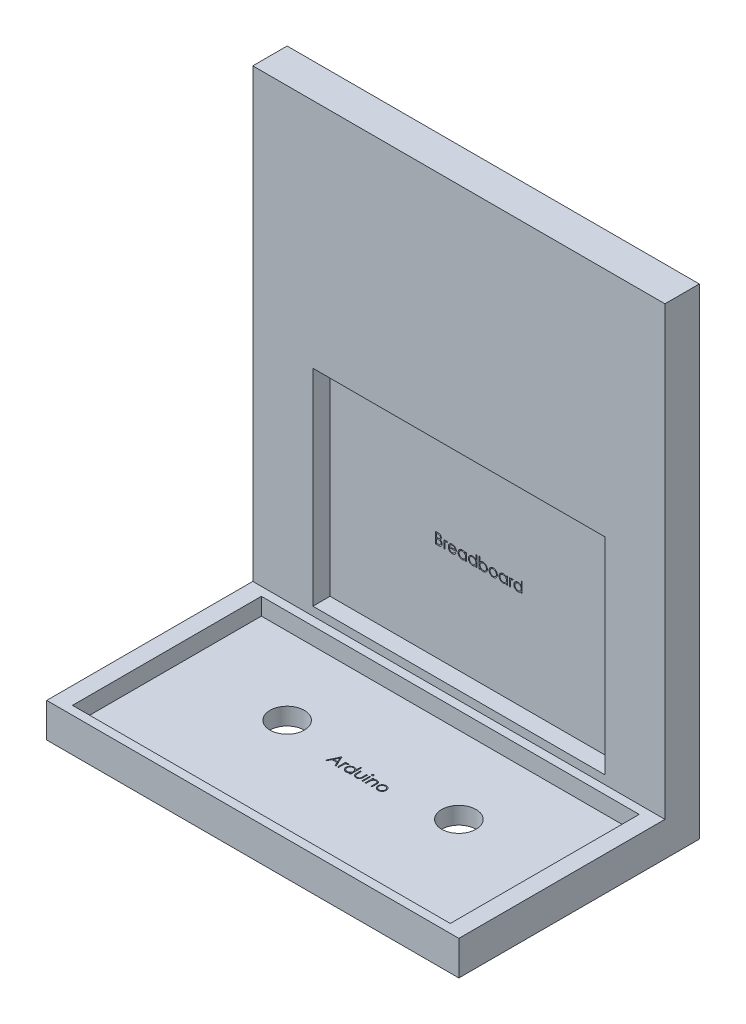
from build123d import *

# Parameters (mm, degrees)
SKETCH1_W           = 120
SKETCH1_H           = 140
BOSS_EXTRUDE1_DEPTH = 70
SKETCH2_W           = 60
SKETCH2_H           = 130
CUT_EXTRUDE1_DEPTH  = 198.230829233
SKETCH3_W           = 110
SKETCH3_H           = 55
CUT_EXTRUDE2_DEPTH  = 5
SKETCH4_W           = 0.284935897
SKETCH4_H           = 2.320192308
CUT_EXTRUDE3_DEPTH  = 2
SKETCH5_W           = 85
SKETCH5_H           = 60
CUT_EXTRUDE4_DEPTH  = 5
CUT_EXTRUDE5_DEPTH  = 2
SKETCH9_R           = 5
CUT_EXTRUDE7_DEPTH  = 194.713706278


with BuildPart() as part:
    # Sketch1 → Boss-Extrude1 (new body)
    with BuildSketch(Plane.XY):
        with Locations((60, 70)):
            Rectangle(SKETCH1_W, SKETCH1_H)
    extrude(amount=BOSS_EXTRUDE1_DEPTH)

    # Sketch2 → Cut-Extrude1 (cut, through all)
    with BuildSketch(Plane(origin=(120, 0, 0), x_dir=(0, 0, -1), z_dir=(1, 0, 0))):
        with Locations((-40, 75)):
            Rectangle(SKETCH2_W, SKETCH2_H)
    extrude(amount=-CUT_EXTRUDE1_DEPTH, mode=Mode.SUBTRACT)

    # Sketch3 → Cut-Extrude2 (cut)
    with BuildSketch(Plane(origin=(0, 10, 0), x_dir=(1, 0, 0), z_dir=(0, 1, 0))):
        with Locations((60, -40)):
            Rectangle(SKETCH3_W, SKETCH3_H)
    extrude(amount=-CUT_EXTRUDE2_DEPTH, mode=Mode.SUBTRACT)

    # Sketch4 → Cut-Extrude3 (cut)
    # profile 1 of 8: a face of its own
    with BuildSketch(Plane(origin=(0, 5, 0), x_dir=(1, 0, 0), z_dir=(0, 1, 0))):
        Polygon((52.238333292, -36.253131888), (53.703717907, -39.428131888), (53.393977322, -39.428131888), (52.924596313, -38.410503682), (51.48528842, -38.410503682), (51.00255104, -39.428131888), (50.69153842, -39.428131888), (52.197628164, -36.253131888), align=None)
        Polygon((52.21480064, -36.87197704), (51.639840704, -38.084862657), (52.774496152, -38.084862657), align=None, mode=Mode.SUBTRACT)
    # profile 2 of 8: a face of its own
    with BuildSketch(Plane(origin=(0, 5, 0), x_dir=(1, 0, 0), z_dir=(0, 1, 0))):
        with BuildLine():
            Line((54.110769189, -37.10793958), (54.395705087, -37.10793958))
            Line((54.395705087, -37.10793958), (54.395705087, -37.449481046))
            add(Edge.make_bspline(
                [(54.395705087, -37.449481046), (54.416740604, -37.417680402), (54.456970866, -37.356861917), (54.523839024, -37.276426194), (54.592331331, -37.209828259), (54.66277568, -37.156757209), (54.735690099, -37.117012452), (54.809474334, -37.087899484), (54.885289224, -37.070684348), (54.936236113, -37.068385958), (54.961760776, -37.067234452)],
                knots=[0, 0, 0, 0, 1.2804753, 2.448899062, 3.506932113, 4.484331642, 5.4025378, 6.288909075, 7.142734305, 8, 8, 8, 8], degree=3))
            add(Edge.make_bspline(
                [(54.961760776, -37.067234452), (54.981560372, -37.068314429), (55.022299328, -37.070536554), (55.083969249, -37.08614923), (55.147508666, -37.111075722), (55.18845926, -37.134516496), (55.209807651, -37.146736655)],
                knots=[0, 0, 0, 0, 0.901110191, 1.854092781, 2.881294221, 4, 4, 4, 4], degree=3))
            Line((55.209807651, -37.146736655), (55.053347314, -37.393511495))
            add(Edge.make_bspline(
                [(55.053347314, -37.393511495), (55.039641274, -37.387397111), (55.013624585, -37.375790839), (54.9755658, -37.362054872), (54.940476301, -37.353966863), (54.918121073, -37.352741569), (54.907699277, -37.352170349)],
                knots=[0, 0, 0, 0, 1.180555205, 2.24091978, 3.179933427, 4, 4, 4, 4], degree=3))
            add(Edge.make_bspline(
                [(54.907699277, -37.352170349), (54.884834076, -37.353694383), (54.838195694, -37.35680297), (54.76972047, -37.381240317), (54.70327479, -37.420723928), (54.650504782, -37.464512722), (54.609645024, -37.506738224), (54.580489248, -37.543612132), (54.553744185, -37.584958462), (54.528189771, -37.63007039), (54.504906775, -37.679718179), (54.483176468, -37.733405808), (54.463528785, -37.791195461), (54.45232535, -37.831456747), (54.446586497, -37.852080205)],
                knots=[0, 0, 0, 0, 1.125678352, 2.296057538, 3.5422874, 4.923748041, 5.663163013, 6.437101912, 7.23742474, 8.08941207, 8.991984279, 9.93940061, 10.944477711, 12, 12, 12, 12], degree=3))
            add(Edge.make_bspline(
                [(54.446586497, -37.852080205), (54.44229354, -37.870474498), (54.432784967, -37.91121646), (54.423539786, -37.979568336), (54.414405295, -38.060325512), (54.407967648, -38.153712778), (54.402000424, -38.259496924), (54.39863485, -38.377839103), (54.395819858, -38.508860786), (54.395744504, -38.600458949), (54.395705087, -38.648374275)],
                knots=[0, 0, 0, 0, 0.566838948, 1.255505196, 2.06880316, 3.007127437, 4.065329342, 5.249902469, 6.561414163, 8, 8, 8, 8], degree=3))
            Line((54.395705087, -38.648374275), (54.395705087, -39.428131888))
            Line((54.395705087, -39.428131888), (54.110769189, -39.428131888))
            Line((54.110769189, -39.428131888), (54.110769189, -37.10793958))
        make_face()
    # profile 3 of 8: a face of its own
    with BuildSketch(Plane(origin=(0, 5, 0), x_dir=(1, 0, 0), z_dir=(0, 1, 0))):
        with BuildLine():
            Line((57.855640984, -36.171721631), (57.855640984, -39.428131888))
            Line((57.855640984, -39.428131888), (57.570705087, -39.428131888))
            Line((57.570705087, -39.428131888), (57.570705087, -39.026804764))
            add(Edge.make_bspline(
                [(57.570705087, -39.026804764), (57.538575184, -39.063126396), (57.475873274, -39.134008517), (57.371151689, -39.22661163), (57.26014627, -39.303154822), (57.143395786, -39.364976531), (57.021005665, -39.411415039), (56.893247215, -39.444422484), (56.760068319, -39.465644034), (56.669125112, -39.46776314), (56.623038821, -39.468837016)],
                knots=[0, 0, 0, 0, 1.074387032, 2.096679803, 3.090159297, 4.057316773, 5.018401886, 5.985159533, 6.978961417, 8, 8, 8, 8], degree=3))
            add(Edge.make_bspline(
                [(56.623038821, -39.468837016), (56.582065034, -39.467724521), (56.501262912, -39.465530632), (56.382400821, -39.448510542), (56.268017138, -39.421177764), (56.158003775, -39.383167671), (56.053072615, -39.332747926), (55.952325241, -39.272385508), (55.856283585, -39.200502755), (55.766411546, -39.118326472), (55.683651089, -39.029068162), (55.611024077, -38.933867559), (55.550469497, -38.833136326), (55.49983271, -38.728149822), (55.460828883, -38.61809986), (55.433638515, -38.503367), (55.416638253, -38.384086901), (55.41444527, -38.302861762), (55.413333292, -38.261675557)],
                knots=[0, 0, 0, 0, 1.033919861, 2.038935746, 3.024066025, 3.998881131, 4.97069526, 5.957263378, 6.95902576, 7.993208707, 9.027059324, 10.027763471, 11.009749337, 11.988697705, 12.965288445, 13.950418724, 14.960734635, 16, 16, 16, 16], degree=3))
            add(Edge.make_bspline(
                [(55.413333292, -38.261675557), (55.414469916, -38.221340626), (55.41671696, -38.141600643), (55.433456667, -38.024326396), (55.461606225, -37.911370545), (55.501110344, -37.803096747), (55.551766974, -37.699373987), (55.613387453, -37.600128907), (55.685976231, -37.505088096), (55.769662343, -37.416486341), (55.860317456, -37.334643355), (55.957298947, -37.263515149), (56.058194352, -37.202086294), (56.164568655, -37.153414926), (56.274847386, -37.114036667), (56.390012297, -37.086792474), (56.509584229, -37.070738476), (56.59076489, -37.068413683), (56.631943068, -37.067234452)],
                knots=[0, 0, 0, 0, 1.020392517, 2.01726096, 2.990465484, 3.961182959, 4.928053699, 5.906110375, 6.912531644, 7.948652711, 8.985773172, 9.998621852, 10.987621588, 11.969261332, 12.953316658, 13.946091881, 14.958173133, 16, 16, 16, 16], degree=3))
            add(Edge.make_bspline(
                [(56.631943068, -37.067234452), (56.679311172, -37.068656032), (56.772289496, -37.071446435), (56.908268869, -37.094765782), (57.036890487, -37.133920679), (57.15889484, -37.187524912), (57.273554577, -37.257194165), (57.381710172, -37.341332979), (57.481480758, -37.442322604), (57.540510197, -37.518170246), (57.570705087, -37.556968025)],
                knots=[0, 0, 0, 0, 1.031072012, 2.023879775, 2.993683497, 3.952812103, 4.918022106, 5.908088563, 6.929940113, 8, 8, 8, 8], degree=3))
            Line((57.570705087, -37.556968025), (57.570705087, -36.171721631))
            Line((57.570705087, -36.171721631), (57.855640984, -36.171721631))
        make_face()
        with BuildLine():
            add(Edge.make_bspline(
                [(56.635759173, -37.352170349), (56.59410831, -37.353652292), (56.51189613, -37.356577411), (56.391206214, -37.379413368), (56.275714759, -37.417408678), (56.165999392, -37.469371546), (56.063793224, -37.5347119), (55.97244968, -37.61374344), (55.891221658, -37.704309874), (55.822906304, -37.806002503), (55.767216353, -37.9150212), (55.728057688, -38.028980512), (55.702232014, -38.145825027), (55.69959357, -38.225075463), (55.698269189, -38.264855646)],
                knots=[0, 0, 0, 0, 1.031046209, 2.035121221, 3.029706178, 4.034933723, 5.034054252, 6.02443088, 7.017295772, 8.038157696, 9.050218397, 10.03989886, 11.016116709, 12, 12, 12, 12], degree=3))
            add(Edge.make_bspline(
                [(55.698269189, -38.264855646), (55.699960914, -38.3043981), (55.703337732, -38.383328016), (55.727604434, -38.500331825), (55.76831689, -38.614317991), (55.82387219, -38.724319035), (55.893437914, -38.826448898), (55.97407262, -38.918741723), (56.06655609, -38.998107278), (56.168997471, -39.06454422), (56.27840613, -39.118213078), (56.393462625, -39.155556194), (56.512004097, -39.179666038), (56.592605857, -39.182482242), (56.633215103, -39.183901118)],
                knots=[0, 0, 0, 0, 0.979072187, 1.954306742, 2.945804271, 3.96968567, 4.997920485, 5.998718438, 6.996577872, 8.005894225, 9.015743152, 10.005417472, 10.995077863, 12, 12, 12, 12], degree=3))
            add(Edge.make_bspline(
                [(56.633215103, -39.183901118), (56.674441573, -39.182395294), (56.756436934, -39.179400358), (56.877484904, -39.156466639), (56.994955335, -39.118576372), (57.107248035, -39.066053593), (57.21185624, -39.00095942), (57.3057436, -38.924752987), (57.385133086, -38.836122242), (57.452436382, -38.738716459), (57.505209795, -38.631934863), (57.543650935, -38.518238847), (57.566378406, -38.397624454), (57.569242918, -38.315197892), (57.570705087, -38.273123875)],
                knots=[0, 0, 0, 0, 1.01762866, 2.023962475, 3.030623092, 4.058876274, 5.077231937, 6.066672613, 7.034107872, 8.005628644, 8.981990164, 9.965428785, 10.961468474, 12, 12, 12, 12], degree=3))
            add(Edge.make_bspline(
                [(57.570705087, -38.273123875), (57.569834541, -38.241067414), (57.568121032, -38.177970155), (57.555030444, -38.085325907), (57.534207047, -37.996667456), (57.50486445, -37.911901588), (57.466318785, -37.831496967), (57.41982974, -37.75487627), (57.364579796, -37.682438), (57.30145835, -37.615179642), (57.232365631, -37.55383278), (57.159254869, -37.49907379), (57.081259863, -37.454089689), (56.999692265, -37.416859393), (56.914410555, -37.387232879), (56.824720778, -37.367468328), (56.731576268, -37.353897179), (56.66803449, -37.35275202), (56.635759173, -37.352170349)],
                knots=[0, 0, 0, 0, 1.050140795, 2.067009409, 3.05949893, 4.030605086, 5.00011959, 5.97591094, 6.962425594, 7.979863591, 8.993523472, 9.986985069, 10.967611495, 11.937549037, 12.921786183, 13.919465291, 14.943216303, 16, 16, 16, 16], degree=3))
        make_face(mode=Mode.SUBTRACT)
    # profile 4 of 8: a face of its own
    with BuildSketch(Plane(origin=(0, 5, 0), x_dir=(1, 0, 0), z_dir=(0, 1, 0))):
        with BuildLine():
            Line((58.466217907, -37.10793958), (58.751153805, -37.10793958))
            Line((58.751153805, -37.10793958), (58.751153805, -38.184081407))
            add(Edge.make_bspline(
                [(58.751153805, -38.184081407), (58.751282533, -38.215670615), (58.751528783, -38.276099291), (58.75319878, -38.363053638), (58.757126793, -38.442353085), (58.762037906, -38.514043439), (58.768353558, -38.578112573), (58.775867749, -38.634336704), (58.78426646, -38.683353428), (58.792487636, -38.712874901), (58.796311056, -38.726604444)],
                knots=[0, 0, 0, 0, 1.388932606, 2.656963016, 3.823490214, 4.879454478, 5.816252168, 6.653371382, 7.373723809, 8, 8, 8, 8], degree=3))
            add(Edge.make_bspline(
                [(58.796311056, -38.726604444), (58.802444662, -38.743860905), (58.814584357, -38.778015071), (58.836603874, -38.827353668), (58.863843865, -38.873051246), (58.893652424, -38.91686994), (58.9280326, -38.957511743), (58.966549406, -38.994908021), (59.007913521, -39.030471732), (59.069377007, -39.072549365), (59.153432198, -39.117648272), (59.263788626, -39.156560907), (59.383444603, -39.179816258), (59.466144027, -39.182514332), (59.5086508, -39.183901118)],
                knots=[0, 0, 0, 0, 0.725840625, 1.436591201, 2.137033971, 2.831655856, 3.53531722, 4.242432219, 4.957935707, 5.694543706, 7.190802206, 8.724350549, 10.316345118, 12, 12, 12, 12], degree=3))
            add(Edge.make_bspline(
                [(59.5086508, -39.183901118), (59.551153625, -39.182484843), (59.633388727, -39.179744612), (59.75173002, -39.157262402), (59.859908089, -39.119701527), (59.956837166, -39.067261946), (60.042077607, -39.003088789), (60.113110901, -38.927787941), (60.171718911, -38.843741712), (60.197308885, -38.781036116), (60.210178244, -38.749501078)],
                knots=[0, 0, 0, 0, 1.157059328, 2.238695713, 3.266970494, 4.264342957, 5.228770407, 6.160125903, 7.074715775, 8, 8, 8, 8], degree=3))
            add(Edge.make_bspline(
                [(60.210178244, -38.749501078), (60.21398301, -38.73683165), (60.222394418, -38.708822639), (60.231431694, -38.661306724), (60.239572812, -38.604642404), (60.246524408, -38.538458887), (60.251482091, -38.462929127), (60.254154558, -38.378076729), (60.257173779, -38.284168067), (60.257219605, -38.218429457), (60.257243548, -38.184081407)],
                knots=[0, 0, 0, 0, 0.557542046, 1.232589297, 2.036731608, 2.971723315, 4.038036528, 5.22795436, 6.551621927, 8, 8, 8, 8], degree=3))
            Line((60.257243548, -38.184081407), (60.257243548, -37.10793958))
            Line((60.257243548, -37.10793958), (60.542179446, -37.10793958))
            Line((60.542179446, -37.10793958), (60.542179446, -38.237506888))
            add(Edge.make_bspline(
                [(60.542179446, -38.237506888), (60.541778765, -38.275885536), (60.541001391, -38.350345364), (60.536005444, -38.458553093), (60.527433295, -38.55939313), (60.514422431, -38.652918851), (60.499122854, -38.739058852), (60.479386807, -38.817923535), (60.455820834, -38.889269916), (60.429236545, -38.954349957), (60.397829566, -39.013356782), (60.364422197, -39.069359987), (60.325846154, -39.120970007), (60.285233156, -39.170755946), (60.240055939, -39.216241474), (60.191161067, -39.258470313), (60.139236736, -39.298087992), (60.083130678, -39.333549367), (60.023661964, -39.365495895), (59.960757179, -39.393813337), (59.893645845, -39.416222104), (59.823193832, -39.435553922), (59.749055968, -39.450716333), (59.671303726, -39.461408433), (59.589963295, -39.46796284), (59.534528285, -39.468540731), (59.506106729, -39.468837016)],
                knots=[0, 0, 0, 0, 1.493040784, 2.896703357, 4.213163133, 5.428574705, 6.569057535, 7.615249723, 8.588095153, 9.490268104, 10.346124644, 11.18633936, 12.024365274, 12.850166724, 13.684164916, 14.514361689, 15.362232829, 16.222528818, 17.093394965, 17.986930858, 18.902426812, 19.842810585, 20.827885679, 21.843828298, 22.894529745, 24, 24, 24, 24], degree=3))
            add(Edge.make_bspline(
                [(59.506106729, -39.468837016), (59.477897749, -39.468528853), (59.422464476, -39.467923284), (59.341119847, -39.461444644), (59.263152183, -39.450732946), (59.188838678, -39.435442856), (59.118104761, -39.416357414), (59.050663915, -39.393675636), (58.987305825, -39.365481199), (58.927269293, -39.333751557), (58.87102427, -39.2978602), (58.818311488, -39.258519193), (58.769201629, -39.215787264), (58.72368386, -39.169842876), (58.682397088, -39.120116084), (58.644826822, -39.067006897), (58.610394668, -39.011041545), (58.57923178, -38.951112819), (58.552460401, -38.885279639), (58.528824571, -38.812438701), (58.509492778, -38.731791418), (58.493760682, -38.64340674), (58.481104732, -38.547707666), (58.472318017, -38.444140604), (58.467405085, -38.332957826), (58.466622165, -38.256168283), (58.466217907, -38.216518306)],
                knots=[0, 0, 0, 0, 1.083640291, 2.129454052, 3.13281866, 4.105697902, 5.042300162, 5.946461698, 6.836384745, 7.703652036, 8.553297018, 9.397182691, 10.228592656, 11.052265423, 11.879314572, 12.708807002, 13.549817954, 14.402308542, 15.300838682, 16.27712199, 17.341985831, 18.484375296, 19.725102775, 21.0496083, 22.476576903, 24, 24, 24, 24], degree=3))
            Line((58.466217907, -38.216518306), (58.466217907, -37.10793958))
        make_face()
    # profile 5 of 8: a face of its own
    with BuildSketch(Plane(origin=(0, 5, 0), x_dir=(1, 0, 0), z_dir=(0, 1, 0))):
        with BuildLine():
            add(Edge.make_bspline(
                [(61.293952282, -36.131016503), (61.31163369, -36.131836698), (61.346257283, -36.133442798), (61.396325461, -36.147196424), (61.441915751, -36.17050971), (61.482354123, -36.201787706), (61.517054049, -36.238571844), (61.541347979, -36.281444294), (61.556962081, -36.327761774), (61.558847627, -36.360069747), (61.559807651, -36.376519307)],
                knots=[0, 0, 0, 0, 1.055194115, 2.066272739, 3.074728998, 4.095836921, 5.109056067, 6.073838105, 7.019297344, 8, 8, 8, 8], degree=3))
            add(Edge.make_bspline(
                [(61.559807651, -36.376519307), (61.558825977, -36.392541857), (61.556885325, -36.424216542), (61.541360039, -36.469731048), (61.516847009, -36.512007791), (61.482376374, -36.548720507), (61.441909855, -36.579981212), (61.396327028, -36.603299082), (61.346256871, -36.617051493), (61.311633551, -36.61865776), (61.293952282, -36.619478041)],
                knots=[0, 0, 0, 0, 0.96129708, 1.900370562, 2.859976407, 3.87933698, 4.906634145, 5.921202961, 6.938410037, 8, 8, 8, 8], degree=3))
            add(Edge.make_bspline(
                [(61.293952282, -36.619478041), (61.276473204, -36.618689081), (61.242452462, -36.617153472), (61.193133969, -36.603029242), (61.147932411, -36.579973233), (61.107415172, -36.548925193), (61.073642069, -36.511782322), (61.049060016, -36.469756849), (61.033570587, -36.424209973), (61.031625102, -36.39253965), (61.030640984, -36.376519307)],
                knots=[0, 0, 0, 0, 1.054934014, 2.053291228, 3.073705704, 4.106921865, 5.123545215, 6.088680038, 7.033164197, 8, 8, 8, 8], degree=3))
            add(Edge.make_bspline(
                [(61.030640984, -36.376519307), (61.031603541, -36.360072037), (61.033494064, -36.327768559), (61.049071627, -36.281418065), (61.07343731, -36.238799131), (61.107437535, -36.201583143), (61.14792646, -36.170517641), (61.193135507, -36.147466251), (61.242452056, -36.133340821), (61.276473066, -36.131805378), (61.293952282, -36.131016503)],
                knots=[0, 0, 0, 0, 0.98631895, 1.937192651, 2.907499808, 3.917963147, 4.944918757, 5.95915025, 6.951458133, 8, 8, 8, 8], degree=3))
        make_face()
    # profile 6 of 8: a face of its own
    with BuildSketch(Plane(origin=(0, 5, 0), x_dir=(1, 0, 0), z_dir=(0, 1, 0))):
        with Locations((61.295224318, -38.268035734)):
            Rectangle(SKETCH4_W, SKETCH4_H)
    # profile 7 of 8: a face of its own
    with BuildSketch(Plane(origin=(0, 5, 0), x_dir=(1, 0, 0), z_dir=(0, 1, 0))):
        with BuildLine():
            Line((62.129679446, -37.10793958), (62.414615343, -37.10793958))
            Line((62.414615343, -37.10793958), (62.414615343, -37.526439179))
            add(Edge.make_bspline(
                [(62.414615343, -37.526439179), (62.445038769, -37.488481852), (62.504076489, -37.414824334), (62.602396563, -37.318013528), (62.706304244, -37.238234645), (62.815163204, -37.174640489), (62.929121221, -37.126701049), (63.047483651, -37.092079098), (63.170959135, -37.071319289), (63.254928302, -37.068606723), (63.297407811, -37.067234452)],
                knots=[0, 0, 0, 0, 1.12780773, 2.188550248, 3.19190651, 4.159438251, 5.104880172, 6.052711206, 7.014878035, 8, 8, 8, 8], degree=3))
            add(Edge.make_bspline(
                [(63.297407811, -37.067234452), (63.340343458, -37.068817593), (63.424378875, -37.071916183), (63.546732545, -37.096424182), (63.661008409, -37.13828452), (63.766799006, -37.195626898), (63.862164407, -37.266934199), (63.945916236, -37.35000833), (64.015188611, -37.445563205), (64.061631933, -37.534212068), (64.092225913, -37.612851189), (64.111486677, -37.680203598), (64.127843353, -37.755240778), (64.142023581, -37.837735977), (64.151618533, -37.928267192), (64.159186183, -38.026463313), (64.164609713, -38.132292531), (64.164824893, -38.205486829), (64.164935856, -38.243231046)],
                knots=[0, 0, 0, 0, 1.235846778, 2.418850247, 3.575807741, 4.728682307, 5.871620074, 6.994088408, 8.11269785, 9.256955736, 9.865816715, 10.540099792, 11.271859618, 12.076849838, 12.949306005, 13.892391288, 14.913166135, 16, 16, 16, 16], degree=3))
            Line((64.164935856, -38.243231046), (64.164935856, -39.428131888))
            Line((64.164935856, -39.428131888), (63.879999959, -39.428131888))
            Line((63.879999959, -39.428131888), (63.879999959, -38.336725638))
            add(Edge.make_bspline(
                [(63.879999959, -38.336725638), (63.879824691, -38.305136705), (63.879489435, -38.244712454), (63.878432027, -38.158199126), (63.875883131, -38.079743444), (63.872301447, -38.009532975), (63.867059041, -37.947635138), (63.861595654, -37.893923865), (63.854914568, -37.848467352), (63.848961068, -37.821103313), (63.846291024, -37.808831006)],
                knots=[0, 0, 0, 0, 1.430800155, 2.736877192, 3.918605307, 4.986035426, 5.920637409, 6.731861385, 7.431261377, 8, 8, 8, 8], degree=3))
            add(Edge.make_bspline(
                [(63.846291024, -37.808831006), (63.836652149, -37.772807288), (63.818100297, -37.703472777), (63.772258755, -37.609425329), (63.714370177, -37.529416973), (63.643705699, -37.463942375), (63.560947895, -37.412987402), (63.466326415, -37.377632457), (63.360754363, -37.355519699), (63.286500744, -37.353317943), (63.247798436, -37.352170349)],
                knots=[0, 0, 0, 0, 1.084156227, 2.086665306, 3.027808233, 3.945421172, 4.874247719, 5.839848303, 6.874090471, 8, 8, 8, 8], degree=3))
            add(Edge.make_bspline(
                [(63.247798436, -37.352170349), (63.224877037, -37.352602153), (63.179516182, -37.353456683), (63.112251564, -37.36203036), (63.047006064, -37.376053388), (62.983124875, -37.394984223), (62.921885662, -37.420984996), (62.861320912, -37.450493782), (62.803711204, -37.487276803), (62.747828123, -37.528271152), (62.695837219, -37.573700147), (62.647460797, -37.621637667), (62.604337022, -37.672687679), (62.565267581, -37.726027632), (62.531541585, -37.782390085), (62.502101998, -37.841231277), (62.477123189, -37.902628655), (62.464711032, -37.945241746), (62.45850056, -37.966563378)],
                knots=[0, 0, 0, 0, 1.023777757, 2.026029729, 3.023749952, 4.003683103, 4.997618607, 5.993177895, 7.010360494, 8.046726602, 9.087585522, 10.09234134, 11.086953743, 12.070360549, 13.043493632, 14.017870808, 15.008233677, 16, 16, 16, 16], degree=3))
            add(Edge.make_bspline(
                [(62.45850056, -37.966563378), (62.454926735, -37.982216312), (62.447146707, -38.016291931), (62.43874368, -38.072212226), (62.431116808, -38.13690056), (62.424733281, -38.210281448), (62.420827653, -38.292611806), (62.416569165, -38.38354003), (62.415018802, -38.483428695), (62.414753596, -38.552971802), (62.414615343, -38.589224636)],
                knots=[0, 0, 0, 0, 0.615963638, 1.340920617, 2.168419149, 3.115676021, 4.16674242, 5.331190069, 6.6087489, 8, 8, 8, 8], degree=3))
            Line((62.414615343, -38.589224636), (62.414615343, -39.428131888))
            Line((62.414615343, -39.428131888), (62.129679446, -39.428131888))
            Line((62.129679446, -39.428131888), (62.129679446, -37.10793958))
        make_face()
    # profile 8 of 8: a face of its own
    with BuildSketch(Plane(origin=(0, 5, 0), x_dir=(1, 0, 0), z_dir=(0, 1, 0))):
        with BuildLine():
            add(Edge.make_bspline(
                [(65.936880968, -37.067234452), (65.980415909, -37.068161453), (66.065777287, -37.069979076), (66.190788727, -37.089405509), (66.310118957, -37.119112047), (66.424225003, -37.160179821), (66.531645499, -37.215227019), (66.633945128, -37.28091259), (66.730843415, -37.358729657), (66.788921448, -37.418925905), (66.818401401, -37.449481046)],
                knots=[0, 0, 0, 0, 1.054011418, 2.066658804, 3.057071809, 4.030435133, 4.997543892, 5.974964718, 6.972108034, 8, 8, 8, 8], degree=3))
            add(Edge.make_bspline(
                [(66.818401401, -37.449481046), (66.843785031, -37.478703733), (66.894061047, -37.536583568), (66.958527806, -37.630432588), (67.014064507, -37.727623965), (67.058571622, -37.829448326), (67.093664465, -37.935016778), (67.118579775, -38.044692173), (67.133399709, -38.158232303), (67.135398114, -38.235342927), (67.136410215, -38.27439591)],
                knots=[0, 0, 0, 0, 1.025258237, 2.030674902, 3.01204498, 3.988269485, 4.97094183, 5.956517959, 6.965070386, 8, 8, 8, 8], degree=3))
            add(Edge.make_bspline(
                [(67.136410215, -38.27439591), (67.135520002, -38.313675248), (67.133760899, -38.391293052), (67.117120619, -38.505610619), (67.091238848, -38.61645878), (67.054198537, -38.723373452), (67.006702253, -38.826681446), (66.948744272, -38.925931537), (66.879917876, -39.021319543), (66.801899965, -39.112035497), (66.715674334, -39.19564342), (66.622133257, -39.268512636), (66.523114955, -39.33094359), (66.41730277, -39.381232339), (66.305662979, -39.420883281), (66.187954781, -39.448732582), (66.064361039, -39.465570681), (65.979972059, -39.467732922), (65.936880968, -39.468837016)],
                knots=[0, 0, 0, 0, 0.998656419, 1.973391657, 2.932242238, 3.890759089, 4.846373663, 5.82037756, 6.809684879, 7.83454468, 8.860553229, 9.859544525, 10.845671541, 11.83227036, 12.833544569, 13.85385346, 14.904124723, 16, 16, 16, 16], degree=3))
            add(Edge.make_bspline(
                [(65.936880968, -39.468837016), (65.893578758, -39.467729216), (65.808769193, -39.465559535), (65.684739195, -39.448798), (65.566820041, -39.420896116), (65.455034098, -39.381102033), (65.348766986, -39.330941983), (65.24917495, -39.268701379), (65.155557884, -39.195621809), (65.069314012, -39.112041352), (64.991300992, -39.021318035), (64.922473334, -38.925931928), (64.864515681, -38.826681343), (64.81701931, -38.723373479), (64.779979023, -38.616458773), (64.754097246, -38.505610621), (64.737456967, -38.391293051), (64.735697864, -38.313675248), (64.734807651, -38.27439591)],
                knots=[0, 0, 0, 0, 1.099876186, 2.154163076, 3.173186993, 4.173200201, 5.163417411, 6.152872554, 7.150605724, 8.17532212, 9.198891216, 10.186952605, 11.159729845, 12.11414092, 13.071450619, 14.029093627, 15.002601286, 16, 16, 16, 16], degree=3))
            add(Edge.make_bspline(
                [(64.734807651, -38.27439591), (64.735826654, -38.235555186), (64.737844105, -38.158657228), (64.752649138, -38.045330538), (64.777467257, -37.935840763), (64.812602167, -37.830679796), (64.857519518, -37.72930165), (64.912275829, -37.631870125), (64.977400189, -37.538445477), (65.027476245, -37.480640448), (65.052816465, -37.451389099)],
                knots=[0, 0, 0, 0, 1.031353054, 2.041901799, 3.029428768, 4.008703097, 4.981709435, 5.96992636, 6.972712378, 8, 8, 8, 8], degree=3))
            add(Edge.make_bspline(
                [(65.052816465, -37.451389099), (65.082251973, -37.420568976), (65.140142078, -37.35995578), (65.237522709, -37.282365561), (65.339570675, -37.215313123), (65.448178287, -37.161359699), (65.562190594, -37.118870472), (65.682132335, -37.089328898), (65.807567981, -37.070049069), (65.893347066, -37.068182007), (65.936880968, -37.067234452)],
                knots=[0, 0, 0, 0, 1.027980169, 2.021703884, 2.998553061, 3.971491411, 4.943284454, 5.930300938, 6.949603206, 8, 8, 8, 8], degree=3))
        make_face()
        with BuildLine():
            add(Edge.make_bspline(
                [(65.935608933, -37.352170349), (65.904822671, -37.353045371), (65.84404489, -37.354772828), (65.754582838, -37.367911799), (65.668458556, -37.388728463), (65.585508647, -37.418305), (65.506012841, -37.456494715), (65.429895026, -37.503401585), (65.356931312, -37.558404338), (65.288549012, -37.621416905), (65.225790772, -37.690249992), (65.170928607, -37.763591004), (65.124278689, -37.840250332), (65.085416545, -37.920307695), (65.056472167, -38.004574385), (65.035450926, -38.0920961), (65.02232435, -38.183051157), (65.020613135, -38.244882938), (65.019743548, -38.276303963)],
                knots=[0, 0, 0, 0, 1.021534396, 2.016698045, 2.994645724, 3.958388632, 4.93408049, 5.916473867, 6.921342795, 7.962252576, 8.998418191, 10.008913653, 10.997312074, 11.973003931, 12.956656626, 13.948281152, 14.957379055, 16, 16, 16, 16], degree=3))
            add(Edge.make_bspline(
                [(65.019743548, -38.276303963), (65.021201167, -38.316900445), (65.024094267, -38.39747687), (65.047621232, -38.516141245), (65.086978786, -38.630061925), (65.140125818, -38.738571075), (65.206715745, -38.838966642), (65.28517187, -38.928475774), (65.374652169, -39.005751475), (65.474089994, -39.069869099), (65.581454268, -39.12081402), (65.695079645, -39.156917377), (65.813589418, -39.180386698), (65.894579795, -39.182719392), (65.935608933, -39.183901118)],
                knots=[0, 0, 0, 0, 1.016792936, 2.018143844, 3.017858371, 4.030088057, 5.03801393, 6.028138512, 7.003788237, 7.991172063, 8.984598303, 9.972568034, 10.972917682, 12, 12, 12, 12], degree=3))
            add(Edge.make_bspline(
                [(65.935608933, -39.183901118), (65.97663571, -39.182712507), (66.05762143, -39.180366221), (66.17596654, -39.157035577), (66.289281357, -39.120655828), (66.396534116, -39.069926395), (66.495926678, -39.00550799), (66.586050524, -38.928912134), (66.663836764, -38.838729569), (66.73036082, -38.738438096), (66.784378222, -38.630230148), (66.823551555, -38.51612022), (66.847135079, -38.397482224), (66.850020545, -38.316902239), (66.851474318, -38.276303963)],
                knots=[0, 0, 0, 0, 1.02726834, 2.027799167, 3.010890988, 4.004497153, 4.992059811, 5.971914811, 6.958719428, 7.966827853, 8.981595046, 9.981490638, 10.983022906, 12, 12, 12, 12], degree=3))
            add(Edge.make_bspline(
                [(66.851474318, -38.276303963), (66.85060503, -38.24488275), (66.848894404, -38.183050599), (66.835763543, -38.092098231), (66.814758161, -38.004566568), (66.785755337, -37.920336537), (66.747062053, -37.84004305), (66.699512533, -37.763816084), (66.644874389, -37.689995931), (66.581358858, -37.621639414), (66.513047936, -37.558379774), (66.440054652, -37.503380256), (66.364049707, -37.456700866), (66.28478485, -37.417978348), (66.201824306, -37.388997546), (66.115820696, -37.367791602), (66.026740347, -37.354828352), (65.966180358, -37.353062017), (65.935608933, -37.352170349)],
                knots=[0, 0, 0, 0, 1.042956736, 2.052379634, 3.044323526, 4.02829302, 5.004299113, 5.996692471, 7.007513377, 8.048758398, 9.090003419, 10.095195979, 11.07790575, 12.047570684, 13.018257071, 13.989683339, 14.985167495, 16, 16, 16, 16], degree=3))
        make_face(mode=Mode.SUBTRACT)
    extrude(amount=-CUT_EXTRUDE3_DEPTH, mode=Mode.SUBTRACT)

    # Sketch5 → Cut-Extrude4 (cut)
    with BuildSketch(Plane.XY.offset(10)):
        with Locations((60, 42.5)):
            Rectangle(SKETCH5_W, SKETCH5_H)
    extrude(amount=-CUT_EXTRUDE4_DEPTH, mode=Mode.SUBTRACT)

    # Sketch7 → Cut-Extrude5 (cut)
    # profile 1 of 10: a face of its own
    with BuildSketch(Plane.XY.offset(5)):
        with BuildLine():
            Line((48.257149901, 44.229646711), (48.876631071, 44.229646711))
            add(Edge.make_bspline(
                [(48.876631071, 44.229646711), (48.906955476, 44.22948728), (48.965731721, 44.229178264), (49.051202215, 44.224385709), (49.131256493, 44.217850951), (49.205917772, 44.207482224), (49.275151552, 44.194971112), (49.33916648, 44.179820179), (49.397758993, 44.16165318), (49.467711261, 44.132764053), (49.547467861, 44.089835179), (49.633826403, 44.02639998), (49.707671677, 43.948809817), (49.771340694, 43.861286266), (49.821960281, 43.765005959), (49.858581, 43.662263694), (49.881765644, 43.554384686), (49.88415001, 43.48032266), (49.88535503, 43.442892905)],
                knots=[0, 0, 0, 0, 1.001505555, 1.941167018, 2.826882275, 3.653841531, 4.429895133, 5.150066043, 5.825578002, 6.45369114, 7.647487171, 8.808567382, 9.977351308, 11.170798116, 12.373658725, 13.556498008, 14.765093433, 16, 16, 16, 16], degree=3))
            add(Edge.make_bspline(
                [(49.88535503, 43.442892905), (49.884363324, 43.407829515), (49.88241453, 43.338926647), (49.863779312, 43.23814842), (49.834604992, 43.142216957), (49.794050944, 43.051482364), (49.741344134, 42.96799473), (49.678879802, 42.891080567), (49.603517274, 42.823996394), (49.547053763, 42.786492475), (49.518372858, 42.767442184)],
                knots=[0, 0, 0, 0, 1.044552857, 2.05264487, 3.044412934, 4.028983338, 5.005914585, 5.980388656, 6.974128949, 8, 8, 8, 8], degree=3))
            add(Edge.make_bspline(
                [(49.518372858, 42.767442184), (49.554441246, 42.753594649), (49.623449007, 42.727100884), (49.718414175, 42.680260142), (49.800233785, 42.629313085), (49.86953691, 42.573676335), (49.928807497, 42.5137062), (49.980562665, 42.448523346), (50.024723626, 42.377277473), (50.062563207, 42.300711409), (50.092089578, 42.219606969), (50.114202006, 42.134724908), (50.126872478, 42.046369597), (50.128675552, 41.986239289), (50.129585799, 41.95588369)],
                knots=[0, 0, 0, 0, 1.27268992, 2.434971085, 3.483601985, 4.442670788, 5.356604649, 6.2567628, 7.179492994, 8.113709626, 9.066344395, 10.018646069, 10.999752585, 12, 12, 12, 12], degree=3))
            add(Edge.make_bspline(
                [(50.129585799, 41.95588369), (50.12869966, 41.924889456), (50.126956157, 41.863907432), (50.114092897, 41.774322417), (50.092313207, 41.688710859), (50.062312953, 41.606519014), (50.023158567, 41.527905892), (49.9755082, 41.452782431), (49.918692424, 41.381903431), (49.855135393, 41.314481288), (49.783233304, 41.253858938), (49.705658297, 41.19986969), (49.621433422, 41.155468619), (49.53194197, 41.118170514), (49.436180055, 41.089679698), (49.334577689, 41.069747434), (49.227222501, 41.056317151), (49.153553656, 41.055212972), (49.115773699, 41.054646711)],
                knots=[0, 0, 0, 0, 0.978564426, 1.925352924, 2.850884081, 3.763762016, 4.682927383, 5.618979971, 6.567305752, 7.547517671, 8.540179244, 9.531824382, 10.526200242, 11.540722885, 12.589160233, 13.674978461, 14.80764778, 16, 16, 16, 16], degree=3))
            Line((49.115773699, 41.054646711), (48.257149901, 41.054646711))
            Line((48.257149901, 41.054646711), (48.257149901, 44.229646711))
        make_face()
        with BuildLine():
            Line((48.542085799, 43.904005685), (48.542085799, 42.88637748))
            Line((48.542085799, 42.88637748), (48.733527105, 42.88637748))
            add(Edge.make_bspline(
                [(48.733527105, 42.88637748), (48.761511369, 42.886740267), (48.815582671, 42.887441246), (48.893887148, 42.889449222), (48.966571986, 42.895071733), (49.033511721, 42.900692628), (49.094600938, 42.909831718), (49.149704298, 42.920710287), (49.199686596, 42.932215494), (49.257326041, 42.9517821), (49.322706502, 42.980699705), (49.392405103, 43.025577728), (49.453849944, 43.079030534), (49.505735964, 43.140708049), (49.548200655, 43.208622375), (49.577695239, 43.281689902), (49.597695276, 43.358089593), (49.599501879, 43.410539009), (49.600419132, 43.437168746)],
                knots=[0, 0, 0, 0, 1.156816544, 2.235205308, 3.236616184, 4.169592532, 5.011045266, 5.787822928, 6.49130361, 7.128639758, 8.301311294, 9.436451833, 10.541879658, 11.654887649, 12.756523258, 13.837046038, 14.901820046, 16, 16, 16, 16], degree=3))
            add(Edge.make_bspline(
                [(49.600419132, 43.437168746), (49.599941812, 43.454790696), (49.599005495, 43.489358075), (49.591337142, 43.539749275), (49.578303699, 43.587141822), (49.561563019, 43.632185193), (49.538168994, 43.673470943), (49.510624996, 43.712426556), (49.477345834, 43.747725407), (49.439465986, 43.780717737), (49.395915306, 43.80996813), (49.346719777, 43.835586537), (49.291213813, 43.85621567), (49.230332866, 43.874282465), (49.163139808, 43.886971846), (49.090410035, 43.897543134), (49.011547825, 43.902924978), (48.956987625, 43.903637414), (48.928784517, 43.904005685)],
                knots=[0, 0, 0, 0, 0.91205012, 1.789085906, 2.630437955, 3.453916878, 4.269457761, 5.079663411, 5.91843418, 6.774407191, 7.675494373, 8.627863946, 9.638891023, 10.736472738, 11.911756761, 13.175263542, 14.539845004, 16, 16, 16, 16], degree=3))
            Line((48.928784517, 43.904005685), (48.542085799, 43.904005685))
        make_face(mode=Mode.SUBTRACT)
        with BuildLine():
            Line((48.542085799, 42.560736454), (48.542085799, 41.380287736))
            Line((48.542085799, 41.380287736), (48.947865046, 41.380287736))
            add(Edge.make_bspline(
                [(48.947865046, 41.380287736), (48.976910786, 41.38063585), (49.03289262, 41.381306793), (49.113720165, 41.383497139), (49.188634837, 41.388479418), (49.257294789, 41.396322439), (49.320441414, 41.404830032), (49.377317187, 41.416270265), (49.428383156, 41.429377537), (49.487596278, 41.449637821), (49.55427446, 41.481112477), (49.626130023, 41.528568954), (49.690016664, 41.585105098), (49.744268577, 41.650538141), (49.78873036, 41.721686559), (49.821074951, 41.797111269), (49.8410238, 41.875565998), (49.843438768, 41.92905723), (49.844649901, 41.95588369)],
                knots=[0, 0, 0, 0, 1.160039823, 2.235823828, 3.228722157, 4.157150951, 4.99529583, 5.772374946, 6.472645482, 7.099169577, 8.269452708, 9.405989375, 10.527446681, 11.663510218, 12.788923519, 13.866172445, 14.929861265, 16, 16, 16, 16], degree=3))
            add(Edge.make_bspline(
                [(49.844649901, 41.95588369), (49.844399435, 41.972659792), (49.843902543, 42.005941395), (49.836408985, 42.054850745), (49.825510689, 42.102227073), (49.81142146, 42.148199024), (49.790902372, 42.191935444), (49.766947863, 42.234301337), (49.738861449, 42.275352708), (49.695097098, 42.327252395), (49.631441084, 42.387048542), (49.540992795, 42.445593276), (49.438147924, 42.492808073), (49.363555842, 42.512855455), (49.325023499, 42.523211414)],
                knots=[0, 0, 0, 0, 0.723448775, 1.435228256, 2.130040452, 2.821711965, 3.505591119, 4.210454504, 4.921174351, 5.648778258, 7.137944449, 8.670945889, 10.280296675, 12, 12, 12, 12], degree=3))
            add(Edge.make_bspline(
                [(49.325023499, 42.523211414), (49.309575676, 42.526345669), (49.276081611, 42.53314138), (49.221464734, 42.540314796), (49.159111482, 42.546705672), (49.088877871, 42.551432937), (49.010675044, 42.556319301), (48.924335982, 42.558219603), (48.830213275, 42.560486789), (48.764905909, 42.560651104), (48.730983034, 42.560736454)],
                knots=[0, 0, 0, 0, 0.634451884, 1.375622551, 2.216452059, 3.157844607, 4.20941857, 5.370758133, 6.634282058, 8, 8, 8, 8], degree=3))
            Line((48.730983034, 42.560736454), (48.542085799, 42.560736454))
        make_face(mode=Mode.SUBTRACT)
    # profile 2 of 10: a face of its own
    with BuildSketch(Plane.XY.offset(5)):
        with BuildLine():
            Line((50.618047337, 43.374839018), (50.902983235, 43.374839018))
            Line((50.902983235, 43.374839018), (50.902983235, 43.033297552))
            add(Edge.make_bspline(
                [(50.902983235, 43.033297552), (50.924018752, 43.065098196), (50.964249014, 43.125916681), (51.031117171, 43.206352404), (51.099609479, 43.27295034), (51.170053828, 43.326021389), (51.242968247, 43.365766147), (51.316752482, 43.394879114), (51.392567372, 43.41209425), (51.443514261, 43.414392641), (51.469038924, 43.415544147)],
                knots=[0, 0, 0, 0, 1.2804753, 2.448899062, 3.506932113, 4.484331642, 5.4025378, 6.288909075, 7.142734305, 8, 8, 8, 8], degree=3))
            add(Edge.make_bspline(
                [(51.469038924, 43.415544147), (51.48883852, 43.414464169), (51.529577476, 43.412242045), (51.591247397, 43.396629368), (51.654786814, 43.371702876), (51.695737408, 43.348262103), (51.717085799, 43.336041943)],
                knots=[0, 0, 0, 0, 0.901110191, 1.854092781, 2.881294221, 4, 4, 4, 4], degree=3))
            Line((51.717085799, 43.336041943), (51.560625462, 43.089267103))
            add(Edge.make_bspline(
                [(51.560625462, 43.089267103), (51.546919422, 43.095381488), (51.520902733, 43.106987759), (51.482843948, 43.120723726), (51.447754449, 43.128811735), (51.425399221, 43.130037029), (51.414977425, 43.130608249)],
                knots=[0, 0, 0, 0, 1.180555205, 2.24091978, 3.179933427, 4, 4, 4, 4], degree=3))
            add(Edge.make_bspline(
                [(51.414977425, 43.130608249), (51.392112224, 43.129084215), (51.345473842, 43.125975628), (51.276998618, 43.101538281), (51.210552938, 43.06205467), (51.15778293, 43.018265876), (51.116923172, 42.976040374), (51.087767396, 42.939166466), (51.061022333, 42.897820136), (51.035467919, 42.852708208), (51.012184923, 42.803060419), (50.990454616, 42.74937279), (50.970806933, 42.691583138), (50.959603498, 42.651321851), (50.953864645, 42.630698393)],
                knots=[0, 0, 0, 0, 1.125678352, 2.296057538, 3.5422874, 4.923748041, 5.663163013, 6.437101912, 7.23742474, 8.08941207, 8.991984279, 9.93940061, 10.944477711, 12, 12, 12, 12], degree=3))
            add(Edge.make_bspline(
                [(50.953864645, 42.630698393), (50.949571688, 42.6123041), (50.940063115, 42.571562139), (50.930817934, 42.503210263), (50.921683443, 42.422453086), (50.915245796, 42.32906582), (50.909278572, 42.223281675), (50.905912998, 42.104939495), (50.903098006, 41.973917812), (50.903022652, 41.882319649), (50.902983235, 41.834404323)],
                knots=[0, 0, 0, 0, 0.566838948, 1.255505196, 2.06880316, 3.007127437, 4.065329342, 5.249902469, 6.561414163, 8, 8, 8, 8], degree=3))
            Line((50.902983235, 41.834404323), (50.902983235, 41.054646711))
            Line((50.902983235, 41.054646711), (50.618047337, 41.054646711))
            Line((50.618047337, 41.054646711), (50.618047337, 43.374839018))
        make_face()
    # profile 3 of 10: a face of its own
    with BuildSketch(Plane.XY.offset(5)):
        with BuildLine():
            Line((53.906258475, 41.787339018), (54.159393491, 41.654411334))
            add(Edge.make_bspline(
                [(54.159393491, 41.654411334), (54.139221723, 41.618630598), (54.099975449, 41.549015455), (54.032483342, 41.453373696), (53.961733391, 41.367333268), (53.884531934, 41.293192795), (53.803188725, 41.228557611), (53.717252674, 41.172008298), (53.626276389, 41.123822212), (53.530255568, 41.083225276), (53.428383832, 41.052010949), (53.320414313, 41.029963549), (53.206140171, 41.016335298), (53.127811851, 41.014752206), (53.087703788, 41.013941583)],
                knots=[0, 0, 0, 0, 1.120438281, 2.179929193, 3.190490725, 4.156257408, 5.095198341, 6.022838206, 6.959905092, 7.901321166, 8.864066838, 9.862729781, 10.905609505, 12, 12, 12, 12], degree=3))
            add(Edge.make_bspline(
                [(53.087703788, 41.013941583), (53.043124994, 41.014982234), (52.956164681, 41.017012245), (52.829582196, 41.034513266), (52.710402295, 41.063063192), (52.598631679, 41.102946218), (52.494544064, 41.155041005), (52.397932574, 41.21850425), (52.308289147, 41.293009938), (52.228438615, 41.379203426), (52.156553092, 41.471443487), (52.093120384, 41.567560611), (52.040091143, 41.667312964), (51.996954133, 41.770065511), (51.962115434, 41.875170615), (51.93783421, 41.983584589), (51.923837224, 42.095014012), (51.921692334, 42.170395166), (51.92061144, 42.208382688)],
                knots=[0, 0, 0, 0, 1.145258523, 2.234067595, 3.276747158, 4.290159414, 5.277019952, 6.260822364, 7.254936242, 8.264827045, 9.274100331, 10.257902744, 11.220704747, 12.172965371, 13.118907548, 14.062713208, 15.023725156, 16, 16, 16, 16], degree=3))
            add(Edge.make_bspline(
                [(51.92061144, 42.208382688), (51.921572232, 42.244028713), (51.923476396, 42.314674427), (51.93547861, 42.419236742), (51.956749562, 42.520862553), (51.985938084, 42.619636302), (52.023631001, 42.715392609), (52.069743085, 42.808189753), (52.124346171, 42.897928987), (52.166503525, 42.954537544), (52.187738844, 42.983052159)],
                knots=[0, 0, 0, 0, 1.024358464, 2.0301432, 3.019427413, 4.004406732, 4.986367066, 5.972626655, 6.978780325, 8, 8, 8, 8], degree=3))
            add(Edge.make_bspline(
                [(52.187738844, 42.983052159), (52.216502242, 43.017404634), (52.273117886, 43.085021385), (52.36887258, 43.173865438), (52.472559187, 43.248290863), (52.582878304, 43.30998305), (52.701112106, 43.35685843), (52.825671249, 43.391790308), (52.95797403, 43.411364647), (53.048420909, 43.414129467), (53.094699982, 43.415544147)],
                knots=[0, 0, 0, 0, 1.030682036, 2.02871468, 2.997146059, 3.962720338, 4.930598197, 5.918074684, 6.934738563, 8, 8, 8, 8], degree=3))
            add(Edge.make_bspline(
                [(53.094699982, 43.415544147), (53.142277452, 43.414315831), (53.235613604, 43.411906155), (53.371714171, 43.389566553), (53.500492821, 43.354140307), (53.621898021, 43.30410794), (53.73594208, 43.239556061), (53.841883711, 43.159598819), (53.941534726, 43.066690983), (53.999508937, 42.9952415), (54.029009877, 42.95888349)],
                knots=[0, 0, 0, 0, 1.056321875, 2.072262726, 3.055038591, 4.01806755, 4.982017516, 5.957941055, 6.960871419, 8, 8, 8, 8], degree=3))
            add(Edge.make_bspline(
                [(54.029009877, 42.95888349), (54.049082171, 42.931484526), (54.089093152, 42.876868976), (54.139210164, 42.787813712), (54.182714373, 42.69464053), (54.217487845, 42.595843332), (54.245645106, 42.492592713), (54.266016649, 42.384150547), (54.277963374, 42.270549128), (54.280311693, 42.193145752), (54.281508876, 42.153685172)],
                knots=[0, 0, 0, 0, 0.94817472, 1.890038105, 2.849395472, 3.817997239, 4.812318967, 5.836947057, 6.897266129, 8, 8, 8, 8], degree=3))
            Line((54.281508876, 42.153685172), (52.205547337, 42.153685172))
            add(Edge.make_bspline(
                [(52.205547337, 42.153685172), (52.20694398, 42.123114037), (52.209690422, 42.062997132), (52.222494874, 41.975030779), (52.24267769, 41.891234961), (52.271043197, 41.812238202), (52.305393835, 41.737008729), (52.347472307, 41.666104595), (52.397673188, 41.599848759), (52.453667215, 41.53764857), (52.515994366, 41.482257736), (52.581565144, 41.432680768), (52.651318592, 41.391128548), (52.72470471, 41.357401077), (52.80160483, 41.33099749), (52.882043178, 41.312974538), (52.965861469, 41.300903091), (53.022998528, 41.299560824), (53.0520868, 41.29887748)],
                knots=[0, 0, 0, 0, 1.094153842, 2.151609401, 3.174256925, 4.172055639, 5.149267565, 6.128595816, 7.11444997, 8.118368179, 9.117203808, 10.09244225, 11.054858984, 12.015122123, 12.976791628, 13.957293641, 14.960065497, 16, 16, 16, 16], degree=3))
            add(Edge.make_bspline(
                [(53.0520868, 41.29887748), (53.08052677, 41.299429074), (53.136957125, 41.300523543), (53.220995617, 41.311166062), (53.303672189, 41.328374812), (53.384644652, 41.351860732), (53.462269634, 41.380505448), (53.534156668, 41.415070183), (53.600269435, 41.453306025), (53.662061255, 41.497039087), (53.721997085, 41.550567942), (53.781453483, 41.617366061), (53.845204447, 41.696366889), (53.885109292, 41.755826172), (53.906258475, 41.787339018)],
                knots=[0, 0, 0, 0, 0.99110716, 1.966546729, 2.947904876, 3.932708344, 4.903319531, 5.828989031, 6.710028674, 7.56322171, 8.463672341, 9.504779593, 10.677557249, 12, 12, 12, 12], degree=3))
        make_face()
        with BuildLine():
            add(Edge.make_bspline(
                [(53.996572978, 42.43862107), (53.986143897, 42.476415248), (53.966071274, 42.549156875), (53.924128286, 42.649886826), (53.87689196, 42.73941085), (53.820992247, 42.817043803), (53.757656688, 42.885989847), (53.684499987, 42.946240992), (53.602461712, 43.000141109), (53.51196592, 43.04563659), (53.416133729, 43.084362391), (53.315798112, 43.11032946), (53.213419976, 43.128118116), (53.144173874, 43.129774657), (53.109328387, 43.130608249)],
                knots=[0, 0, 0, 0, 1.154881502, 2.222775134, 3.210006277, 4.132804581, 5.035138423, 5.962687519, 6.919655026, 7.923214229, 8.944639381, 9.960483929, 10.97369054, 12, 12, 12, 12], degree=3))
            add(Edge.make_bspline(
                [(53.109328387, 43.130608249), (53.080889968, 43.130053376), (53.024673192, 43.128956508), (52.94185008, 43.118551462), (52.862312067, 43.101352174), (52.785472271, 43.077798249), (52.712337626, 43.046403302), (52.6414038, 43.009588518), (52.574474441, 42.964647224), (52.532617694, 42.930394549), (52.511471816, 42.91309022)],
                knots=[0, 0, 0, 0, 1.04873581, 2.073130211, 3.073294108, 4.04793562, 5.032784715, 6.005352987, 6.992311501, 8, 8, 8, 8], degree=3))
            add(Edge.make_bspline(
                [(52.511471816, 42.91309022), (52.496328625, 42.89939752), (52.465682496, 42.871686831), (52.424733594, 42.823944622), (52.385526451, 42.772462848), (52.349845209, 42.715271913), (52.317117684, 42.653023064), (52.286492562, 42.586241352), (52.258927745, 42.514420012), (52.243419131, 42.464370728), (52.235440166, 42.43862107)],
                knots=[0, 0, 0, 0, 0.879870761, 1.780643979, 2.707998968, 3.669668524, 4.684282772, 5.740141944, 6.837334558, 8, 8, 8, 8], degree=3))
            Line((52.235440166, 42.43862107), (53.996572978, 42.43862107))
        make_face(mode=Mode.SUBTRACT)
    # profile 4 of 10: a face of its own
    with BuildSketch(Plane.XY.offset(5)):
        with BuildLine():
            Line((57.212278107, 43.374839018), (57.212278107, 41.054646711))
            Line((57.212278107, 41.054646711), (56.927342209, 41.054646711))
            Line((56.927342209, 41.054646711), (56.927342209, 41.455973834))
            add(Edge.make_bspline(
                [(56.927342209, 41.455973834), (56.895212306, 41.419652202), (56.832510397, 41.348770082), (56.727788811, 41.256166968), (56.616783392, 41.179623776), (56.500032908, 41.117802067), (56.377642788, 41.071363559), (56.249884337, 41.038356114), (56.116705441, 41.017134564), (56.025762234, 41.015015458), (55.979675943, 41.013941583)],
                knots=[0, 0, 0, 0, 1.074387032, 2.096679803, 3.090159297, 4.057316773, 5.018401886, 5.985159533, 6.978961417, 8, 8, 8, 8], degree=3))
            add(Edge.make_bspline(
                [(55.979675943, 41.013941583), (55.938702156, 41.015054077), (55.857900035, 41.017247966), (55.739037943, 41.034268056), (55.62465426, 41.061600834), (55.514640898, 41.099610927), (55.409709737, 41.150030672), (55.308962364, 41.21039309), (55.212920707, 41.282275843), (55.123048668, 41.364452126), (55.040288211, 41.453710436), (54.967661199, 41.548911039), (54.90710662, 41.649642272), (54.856469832, 41.754628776), (54.817466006, 41.864678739), (54.790275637, 41.979411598), (54.773275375, 42.098691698), (54.771082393, 42.179916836), (54.769970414, 42.221103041)],
                knots=[0, 0, 0, 0, 1.033919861, 2.038935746, 3.024066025, 3.998881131, 4.97069526, 5.957263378, 6.95902576, 7.993208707, 9.027059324, 10.027763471, 11.009749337, 11.988697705, 12.965288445, 13.950418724, 14.960734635, 16, 16, 16, 16], degree=3))
            add(Edge.make_bspline(
                [(54.769970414, 42.221103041), (54.771107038, 42.261437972), (54.773354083, 42.341177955), (54.790093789, 42.458452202), (54.818243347, 42.571408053), (54.857747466, 42.679681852), (54.908404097, 42.783404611), (54.970024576, 42.882649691), (55.042613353, 42.977690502), (55.126299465, 43.066292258), (55.216954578, 43.148135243), (55.31393607, 43.219263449), (55.414831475, 43.280692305), (55.521205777, 43.329363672), (55.631484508, 43.368741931), (55.746649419, 43.395986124), (55.866221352, 43.412040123), (55.947402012, 43.414364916), (55.98858019, 43.415544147)],
                knots=[0, 0, 0, 0, 1.020392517, 2.01726096, 2.990465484, 3.961182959, 4.928053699, 5.906110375, 6.912531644, 7.948652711, 8.985773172, 9.998621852, 10.987621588, 11.969261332, 12.953316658, 13.946091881, 14.958173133, 16, 16, 16, 16], degree=3))
            add(Edge.make_bspline(
                [(55.98858019, 43.415544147), (56.035932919, 43.414239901), (56.128789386, 43.411682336), (56.264614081, 43.39039829), (56.393105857, 43.354440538), (56.515256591, 43.305529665), (56.630627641, 43.240534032), (56.738126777, 43.158546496), (56.838879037, 43.060084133), (56.897281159, 42.98445523), (56.927342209, 42.945527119)],
                knots=[0, 0, 0, 0, 1.038897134, 2.037228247, 3.008116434, 3.962042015, 4.918381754, 5.904844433, 6.921570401, 8, 8, 8, 8], degree=3))
            Line((56.927342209, 42.945527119), (56.927342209, 43.374839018))
            Line((56.927342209, 43.374839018), (57.212278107, 43.374839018))
        make_face()
        with BuildLine():
            add(Edge.make_bspline(
                [(55.992396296, 43.130608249), (55.950745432, 43.129126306), (55.868533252, 43.126201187), (55.747843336, 43.103365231), (55.632351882, 43.06536992), (55.522636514, 43.013407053), (55.420430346, 42.948066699), (55.329086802, 42.869035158), (55.24785878, 42.778468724), (55.179543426, 42.676776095), (55.123853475, 42.567757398), (55.084694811, 42.453798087), (55.058869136, 42.336953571), (55.056230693, 42.257703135), (55.054906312, 42.217922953)],
                knots=[0, 0, 0, 0, 1.031046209, 2.035121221, 3.029706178, 4.034933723, 5.034054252, 6.02443088, 7.017295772, 8.038157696, 9.050218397, 10.03989886, 11.016116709, 12, 12, 12, 12], degree=3))
            add(Edge.make_bspline(
                [(55.054906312, 42.217922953), (55.056598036, 42.178380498), (55.059974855, 42.099450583), (55.084241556, 41.982446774), (55.124954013, 41.868460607), (55.180509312, 41.758459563), (55.250075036, 41.6563297), (55.330709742, 41.564036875), (55.423193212, 41.48467132), (55.525634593, 41.418234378), (55.635043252, 41.36456552), (55.750099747, 41.327222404), (55.868641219, 41.30311256), (55.949242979, 41.300296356), (55.989852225, 41.29887748)],
                knots=[0, 0, 0, 0, 0.979072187, 1.954306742, 2.945804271, 3.96968567, 4.997920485, 5.998718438, 6.996577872, 8.005894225, 9.015743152, 10.005417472, 10.995077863, 12, 12, 12, 12], degree=3))
            add(Edge.make_bspline(
                [(55.989852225, 41.29887748), (56.031078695, 41.300383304), (56.113074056, 41.30337824), (56.234122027, 41.326311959), (56.351592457, 41.364202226), (56.463885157, 41.416725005), (56.568493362, 41.481819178), (56.662380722, 41.558025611), (56.741770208, 41.646656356), (56.809073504, 41.744062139), (56.861846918, 41.850843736), (56.900288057, 41.964539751), (56.923015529, 42.085154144), (56.925880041, 42.167580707), (56.927342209, 42.209654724)],
                knots=[0, 0, 0, 0, 1.01762866, 2.023962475, 3.030623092, 4.058876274, 5.077231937, 6.066672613, 7.034107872, 8.005628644, 8.981990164, 9.965428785, 10.961468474, 12, 12, 12, 12], degree=3))
            add(Edge.make_bspline(
                [(56.927342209, 42.209654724), (56.926471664, 42.241711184), (56.924758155, 42.304808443), (56.911667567, 42.397452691), (56.890844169, 42.486111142), (56.861501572, 42.57087701), (56.822955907, 42.651281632), (56.776466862, 42.727902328), (56.721216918, 42.800340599), (56.658095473, 42.867598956), (56.589002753, 42.928945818), (56.515891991, 42.983704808), (56.437896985, 43.028688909), (56.356329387, 43.065919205), (56.271047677, 43.09554572), (56.1813579, 43.11531027), (56.088213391, 43.128881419), (56.024671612, 43.130026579), (55.992396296, 43.130608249)],
                knots=[0, 0, 0, 0, 1.050140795, 2.067009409, 3.05949893, 4.030605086, 5.00011959, 5.97591094, 6.962425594, 7.979863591, 8.993523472, 9.986985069, 10.967611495, 11.937549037, 12.921786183, 13.919465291, 14.943216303, 16, 16, 16, 16], degree=3))
        make_face(mode=Mode.SUBTRACT)
    # profile 5 of 10: a face of its own
    with BuildSketch(Plane.XY.offset(5)):
        with BuildLine():
            Line((60.224457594, 44.311056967), (60.224457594, 41.054646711))
            Line((60.224457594, 41.054646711), (59.939521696, 41.054646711))
            Line((59.939521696, 41.054646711), (59.939521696, 41.455973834))
            add(Edge.make_bspline(
                [(59.939521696, 41.455973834), (59.907391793, 41.419652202), (59.844689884, 41.348770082), (59.739968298, 41.256166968), (59.62896288, 41.179623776), (59.512212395, 41.117802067), (59.389822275, 41.071363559), (59.262063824, 41.038356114), (59.128884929, 41.017134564), (59.037941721, 41.015015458), (58.99185543, 41.013941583)],
                knots=[0, 0, 0, 0, 1.074387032, 2.096679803, 3.090159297, 4.057316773, 5.018401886, 5.985159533, 6.978961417, 8, 8, 8, 8], degree=3))
            add(Edge.make_bspline(
                [(58.99185543, 41.013941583), (58.950881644, 41.015054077), (58.870079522, 41.017247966), (58.751217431, 41.034268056), (58.636833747, 41.061600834), (58.526820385, 41.099610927), (58.421889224, 41.150030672), (58.321141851, 41.21039309), (58.225100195, 41.282275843), (58.135228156, 41.364452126), (58.052467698, 41.453710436), (57.979840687, 41.548911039), (57.919286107, 41.649642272), (57.868649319, 41.754628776), (57.829645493, 41.864678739), (57.802455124, 41.979411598), (57.785454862, 42.098691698), (57.78326188, 42.179916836), (57.782149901, 42.221103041)],
                knots=[0, 0, 0, 0, 1.033919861, 2.038935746, 3.024066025, 3.998881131, 4.97069526, 5.957263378, 6.95902576, 7.993208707, 9.027059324, 10.027763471, 11.009749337, 11.988697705, 12.965288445, 13.950418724, 14.960734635, 16, 16, 16, 16], degree=3))
            add(Edge.make_bspline(
                [(57.782149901, 42.221103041), (57.783286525, 42.261437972), (57.78553357, 42.341177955), (57.802273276, 42.458452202), (57.830422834, 42.571408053), (57.869926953, 42.679681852), (57.920583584, 42.783404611), (57.982204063, 42.882649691), (58.05479284, 42.977690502), (58.138478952, 43.066292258), (58.229134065, 43.148135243), (58.326115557, 43.219263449), (58.427010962, 43.280692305), (58.533385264, 43.329363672), (58.643663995, 43.368741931), (58.758828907, 43.395986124), (58.878400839, 43.412040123), (58.959581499, 43.414364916), (59.000759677, 43.415544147)],
                knots=[0, 0, 0, 0, 1.020392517, 2.01726096, 2.990465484, 3.961182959, 4.928053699, 5.906110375, 6.912531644, 7.948652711, 8.985773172, 9.998621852, 10.987621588, 11.969261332, 12.953316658, 13.946091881, 14.958173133, 16, 16, 16, 16], degree=3))
            add(Edge.make_bspline(
                [(59.000759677, 43.415544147), (59.048127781, 43.414122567), (59.141106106, 43.411332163), (59.277085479, 43.388012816), (59.405707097, 43.34885792), (59.52771145, 43.295253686), (59.642371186, 43.225584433), (59.750526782, 43.14144562), (59.850297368, 43.040455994), (59.909326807, 42.964608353), (59.939521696, 42.925810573)],
                knots=[0, 0, 0, 0, 1.031072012, 2.023879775, 2.993683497, 3.952812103, 4.918022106, 5.908088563, 6.929940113, 8, 8, 8, 8], degree=3))
            Line((59.939521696, 42.925810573), (59.939521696, 44.311056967))
            Line((59.939521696, 44.311056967), (60.224457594, 44.311056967))
        make_face()
        with BuildLine():
            add(Edge.make_bspline(
                [(59.004575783, 43.130608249), (58.962924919, 43.129126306), (58.880712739, 43.126201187), (58.760022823, 43.103365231), (58.644531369, 43.06536992), (58.534816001, 43.013407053), (58.432609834, 42.948066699), (58.341266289, 42.869035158), (58.260038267, 42.778468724), (58.191722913, 42.676776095), (58.136032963, 42.567757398), (58.096874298, 42.453798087), (58.071048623, 42.336953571), (58.06841018, 42.257703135), (58.067085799, 42.217922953)],
                knots=[0, 0, 0, 0, 1.031046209, 2.035121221, 3.029706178, 4.034933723, 5.034054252, 6.02443088, 7.017295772, 8.038157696, 9.050218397, 10.03989886, 11.016116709, 12, 12, 12, 12], degree=3))
            add(Edge.make_bspline(
                [(58.067085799, 42.217922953), (58.068777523, 42.178380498), (58.072154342, 42.099450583), (58.096421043, 41.982446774), (58.1371335, 41.868460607), (58.192688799, 41.758459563), (58.262254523, 41.6563297), (58.34288923, 41.564036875), (58.435372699, 41.48467132), (58.53781408, 41.418234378), (58.647222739, 41.36456552), (58.762279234, 41.327222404), (58.880820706, 41.30311256), (58.961422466, 41.300296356), (59.002031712, 41.29887748)],
                knots=[0, 0, 0, 0, 0.979072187, 1.954306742, 2.945804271, 3.96968567, 4.997920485, 5.998718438, 6.996577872, 8.005894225, 9.015743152, 10.005417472, 10.995077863, 12, 12, 12, 12], degree=3))
            add(Edge.make_bspline(
                [(59.002031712, 41.29887748), (59.043258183, 41.300383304), (59.125253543, 41.30337824), (59.246301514, 41.326311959), (59.363771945, 41.364202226), (59.476064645, 41.416725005), (59.580672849, 41.481819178), (59.67456021, 41.558025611), (59.753949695, 41.646656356), (59.821252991, 41.744062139), (59.874026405, 41.850843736), (59.912467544, 41.964539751), (59.935195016, 42.085154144), (59.938059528, 42.167580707), (59.939521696, 42.209654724)],
                knots=[0, 0, 0, 0, 1.01762866, 2.023962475, 3.030623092, 4.058876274, 5.077231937, 6.066672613, 7.034107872, 8.005628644, 8.981990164, 9.965428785, 10.961468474, 12, 12, 12, 12], degree=3))
            add(Edge.make_bspline(
                [(59.939521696, 42.209654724), (59.938651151, 42.241711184), (59.936937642, 42.304808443), (59.923847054, 42.397452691), (59.903023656, 42.486111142), (59.873681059, 42.57087701), (59.835135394, 42.651281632), (59.788646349, 42.727902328), (59.733396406, 42.800340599), (59.67027496, 42.867598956), (59.60118224, 42.928945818), (59.528071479, 42.983704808), (59.450076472, 43.028688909), (59.368508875, 43.065919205), (59.283227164, 43.09554572), (59.193537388, 43.11531027), (59.100392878, 43.128881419), (59.036851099, 43.130026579), (59.004575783, 43.130608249)],
                knots=[0, 0, 0, 0, 1.050140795, 2.067009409, 3.05949893, 4.030605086, 5.00011959, 5.97591094, 6.962425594, 7.979863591, 8.993523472, 9.986985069, 10.967611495, 11.937549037, 12.921786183, 13.919465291, 14.943216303, 16, 16, 16, 16], degree=3))
        make_face(mode=Mode.SUBTRACT)
    # profile 6 of 10: a face of its own
    with BuildSketch(Plane.XY.offset(5)):
        with BuildLine():
            Line((60.875739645, 41.054646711), (60.875739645, 44.311056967))
            Line((60.875739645, 44.311056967), (61.160675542, 44.311056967))
            Line((61.160675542, 44.311056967), (61.160675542, 42.953795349))
            add(Edge.make_bspline(
                [(61.160675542, 42.953795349), (61.19278243, 42.990768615), (61.25542429, 43.062904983), (61.360450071, 43.157109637), (61.470582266, 43.236985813), (61.586658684, 43.302831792), (61.708844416, 43.352972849), (61.836508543, 43.389641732), (61.969977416, 43.411764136), (62.060981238, 43.41427336), (62.107069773, 43.415544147)],
                knots=[0, 0, 0, 0, 1.077089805, 2.101446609, 3.097517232, 4.067117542, 5.031729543, 5.997785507, 6.985986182, 8, 8, 8, 8], degree=3))
            add(Edge.make_bspline(
                [(62.107069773, 43.415544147), (62.148041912, 43.414419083), (62.229050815, 43.412194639), (62.348142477, 43.39529049), (62.462726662, 43.367878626), (62.572741, 43.329876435), (62.677672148, 43.279454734), (62.778418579, 43.219092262), (62.874464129, 43.147211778), (62.964321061, 43.065026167), (63.047137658, 42.97580266), (63.11962972, 42.880389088), (63.180861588, 42.780172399), (63.231508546, 42.675488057), (63.270670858, 42.56590851), (63.297651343, 42.451541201), (63.314790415, 42.332498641), (63.316949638, 42.251479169), (63.318047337, 42.210290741)],
                knots=[0, 0, 0, 0, 1.034377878, 2.045141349, 3.03070803, 4.00595497, 4.978199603, 5.965204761, 6.967410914, 8.002051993, 9.036360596, 10.037508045, 11.022711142, 11.997267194, 12.969246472, 13.954813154, 14.960274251, 16, 16, 16, 16], degree=3))
            add(Edge.make_bspline(
                [(63.318047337, 42.210290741), (63.316925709, 42.169741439), (63.314714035, 42.089784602), (63.297821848, 41.972122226), (63.269930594, 41.858875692), (63.23005152, 41.75033763), (63.179918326, 41.645998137), (63.117224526, 41.547046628), (63.044824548, 41.451761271), (62.961067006, 41.363202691), (62.87043114, 41.281348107), (62.773444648, 41.210222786), (62.672550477, 41.148793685), (62.566176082, 41.100120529), (62.455896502, 41.060749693), (62.340530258, 41.033428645), (62.220730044, 41.017487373), (62.139342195, 41.015132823), (62.098165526, 41.013941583)],
                knots=[0, 0, 0, 0, 1.024244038, 2.01964794, 2.996620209, 3.965911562, 4.936179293, 5.91563013, 6.920572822, 7.955171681, 8.990768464, 10.002129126, 10.989675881, 11.969873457, 12.952483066, 13.943799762, 14.959703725, 16, 16, 16, 16], degree=3))
            add(Edge.make_bspline(
                [(62.098165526, 41.013941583), (62.051025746, 41.01524842), (61.958592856, 41.0178109), (61.823380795, 41.03905526), (61.695399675, 41.075215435), (61.573191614, 41.123803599), (61.458503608, 41.18959745), (61.350607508, 41.271201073), (61.250183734, 41.369959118), (61.191022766, 41.445307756), (61.160675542, 41.48395861)],
                knots=[0, 0, 0, 0, 1.035807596, 2.031038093, 2.998900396, 3.954262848, 4.914341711, 5.895762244, 6.92060972, 8, 8, 8, 8], degree=3))
            Line((61.160675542, 41.48395861), (61.160675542, 41.054646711))
            Line((61.160675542, 41.054646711), (60.875739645, 41.054646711))
        make_face()
        with BuildLine():
            add(Edge.make_bspline(
                [(62.095621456, 41.29887748), (62.137272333, 41.300359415), (62.219484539, 41.303284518), (62.340174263, 41.326120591), (62.455666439, 41.364115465), (62.565379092, 41.416079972), (62.667595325, 41.481414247), (62.758901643, 41.560468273), (62.840072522, 41.650730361), (62.907792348, 41.752542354), (62.964331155, 41.860901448), (63.003168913, 41.97488785), (63.029221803, 42.09145098), (63.031809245, 42.170504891), (63.03311144, 42.210290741)],
                knots=[0, 0, 0, 0, 1.031910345, 2.036826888, 3.032245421, 4.038315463, 5.03827337, 6.029480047, 7.023177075, 8.037597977, 9.052889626, 10.043399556, 11.015292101, 12, 12, 12, 12], degree=3))
            add(Edge.make_bspline(
                [(63.03311144, 42.210290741), (63.031398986, 42.250037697), (63.027980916, 42.329372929), (63.004055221, 42.446983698), (62.962274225, 42.560909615), (62.906831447, 42.670835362), (62.838008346, 42.773349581), (62.757267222, 42.865415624), (62.66484587, 42.944845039), (62.562498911, 43.011057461), (62.453478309, 43.065086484), (62.338733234, 43.102138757), (62.220661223, 43.126394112), (62.140473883, 43.129196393), (62.100073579, 43.130608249)],
                knots=[0, 0, 0, 0, 0.984795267, 1.965658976, 2.959410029, 3.983795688, 5.009594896, 6.01088574, 7.009236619, 8.019050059, 9.024672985, 10.014834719, 10.999826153, 12, 12, 12, 12], degree=3))
            add(Edge.make_bspline(
                [(62.100073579, 43.130608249), (62.058828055, 43.129197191), (61.976964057, 43.126396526), (61.856161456, 43.102096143), (61.738175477, 43.064860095), (61.62542893, 43.011400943), (61.520332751, 42.945985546), (61.42634131, 42.86911408), (61.345304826, 42.781320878), (61.278590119, 42.682890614), (61.225608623, 42.576587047), (61.187704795, 42.463183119), (61.165026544, 42.343275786), (61.162143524, 42.261058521), (61.160675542, 42.219194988)],
                knots=[0, 0, 0, 0, 1.016820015, 2.018181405, 3.029022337, 4.06341356, 5.088169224, 6.076823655, 7.05054209, 8.02560866, 9.001194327, 9.972267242, 10.967515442, 12, 12, 12, 12], degree=3))
            add(Edge.make_bspline(
                [(61.160675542, 42.219194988), (61.161546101, 42.187138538), (61.163259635, 42.124041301), (61.17635004, 42.031396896), (61.197174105, 41.94273902), (61.226514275, 41.857971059), (61.265068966, 41.777574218), (61.311523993, 41.700924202), (61.366815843, 41.628712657), (61.429323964, 41.561116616), (61.498232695, 41.49960379), (61.57218581, 41.446283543), (61.649672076, 41.400369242), (61.731577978, 41.363770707), (61.816950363, 41.333901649), (61.906665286, 41.314186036), (61.999802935, 41.300601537), (62.063345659, 41.299458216), (62.095621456, 41.29887748)],
                knots=[0, 0, 0, 0, 1.050331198, 2.067384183, 3.060053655, 4.031335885, 5.001026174, 5.976994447, 6.963687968, 7.976578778, 8.990422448, 9.985569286, 10.960374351, 11.936812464, 12.921228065, 13.919088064, 14.943024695, 16, 16, 16, 16], degree=3))
        make_face(mode=Mode.SUBTRACT)
    # profile 7 of 10: a face of its own
    with BuildSketch(Plane.XY.offset(5)):
        with BuildLine():
            add(Edge.make_bspline(
                [(65.008582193, 43.415544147), (65.052117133, 43.414617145), (65.137478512, 43.412799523), (65.262489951, 43.393373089), (65.381820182, 43.363666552), (65.495926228, 43.322598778), (65.603346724, 43.26755158), (65.705646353, 43.201866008), (65.802544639, 43.124048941), (65.860622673, 43.063852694), (65.890102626, 43.033297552)],
                knots=[0, 0, 0, 0, 1.054011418, 2.066658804, 3.057071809, 4.030435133, 4.997543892, 5.974964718, 6.972108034, 8, 8, 8, 8], degree=3))
            add(Edge.make_bspline(
                [(65.890102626, 43.033297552), (65.915486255, 43.004074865), (65.965762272, 42.94619503), (66.030229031, 42.85234601), (66.085765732, 42.755154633), (66.130272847, 42.653330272), (66.16536569, 42.547761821), (66.190281, 42.438086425), (66.205100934, 42.324546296), (66.207099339, 42.247435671), (66.20811144, 42.208382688)],
                knots=[0, 0, 0, 0, 1.025258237, 2.030674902, 3.01204498, 3.988269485, 4.97094183, 5.956517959, 6.965070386, 8, 8, 8, 8], degree=3))
            add(Edge.make_bspline(
                [(66.20811144, 42.208382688), (66.207221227, 42.16910335), (66.205462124, 42.091485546), (66.188821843, 41.977167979), (66.162940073, 41.866319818), (66.125899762, 41.759405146), (66.078403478, 41.656097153), (66.020445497, 41.556847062), (65.951619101, 41.461459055), (65.87360119, 41.370743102), (65.787375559, 41.287135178), (65.693834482, 41.214265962), (65.59481618, 41.151835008), (65.489003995, 41.10154626), (65.377364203, 41.061895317), (65.259656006, 41.034046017), (65.136062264, 41.017207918), (65.051673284, 41.015045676), (65.008582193, 41.013941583)],
                knots=[0, 0, 0, 0, 0.998656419, 1.973391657, 2.932242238, 3.890759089, 4.846373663, 5.82037756, 6.809684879, 7.83454468, 8.860553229, 9.859544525, 10.845671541, 11.83227036, 12.833544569, 13.85385346, 14.904124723, 16, 16, 16, 16], degree=3))
            add(Edge.make_bspline(
                [(65.008582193, 41.013941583), (64.965279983, 41.015049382), (64.880470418, 41.017219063), (64.75644042, 41.033980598), (64.638521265, 41.061882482), (64.526735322, 41.101676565), (64.420468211, 41.151836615), (64.320876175, 41.21407722), (64.227259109, 41.287156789), (64.141015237, 41.370737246), (64.063002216, 41.461460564), (63.994174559, 41.55684667), (63.936216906, 41.656097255), (63.888720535, 41.759405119), (63.851680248, 41.866319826), (63.825798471, 41.977167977), (63.809158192, 42.091485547), (63.807399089, 42.16910335), (63.806508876, 42.208382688)],
                knots=[0, 0, 0, 0, 1.099876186, 2.154163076, 3.173186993, 4.173200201, 5.163417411, 6.152872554, 7.150605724, 8.17532212, 9.198891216, 10.186952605, 11.159729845, 12.11414092, 13.071450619, 14.029093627, 15.002601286, 16, 16, 16, 16], degree=3))
            add(Edge.make_bspline(
                [(63.806508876, 42.208382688), (63.807527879, 42.247223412), (63.809545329, 42.32412137), (63.824350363, 42.437448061), (63.849168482, 42.546937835), (63.884303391, 42.652098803), (63.929220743, 42.753476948), (63.983977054, 42.850908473), (64.049101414, 42.944333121), (64.09917747, 43.002138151), (64.12451769, 43.031389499)],
                knots=[0, 0, 0, 0, 1.031353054, 2.041901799, 3.029428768, 4.008703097, 4.981709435, 5.96992636, 6.972712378, 8, 8, 8, 8], degree=3))
            add(Edge.make_bspline(
                [(64.12451769, 43.031389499), (64.153953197, 43.062209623), (64.211843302, 43.122822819), (64.309223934, 43.200413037), (64.4112719, 43.267465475), (64.519879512, 43.321418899), (64.633891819, 43.363908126), (64.75383356, 43.3934497), (64.879269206, 43.41272953), (64.965048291, 43.414596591), (65.008582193, 43.415544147)],
                knots=[0, 0, 0, 0, 1.027980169, 2.021703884, 2.998553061, 3.971491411, 4.943284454, 5.930300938, 6.949603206, 8, 8, 8, 8], degree=3))
        make_face()
        with BuildLine():
            add(Edge.make_bspline(
                [(65.007310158, 43.130608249), (64.976523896, 43.129733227), (64.915746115, 43.12800577), (64.826284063, 43.1148668), (64.740159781, 43.094050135), (64.657209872, 43.064473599), (64.577714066, 43.026283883), (64.501596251, 42.979377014), (64.428632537, 42.92437426), (64.360250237, 42.861361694), (64.297491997, 42.792528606), (64.242629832, 42.719187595), (64.195979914, 42.642528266), (64.15711777, 42.562470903), (64.128173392, 42.478204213), (64.107152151, 42.390682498), (64.094025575, 42.299727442), (64.09231436, 42.237895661), (64.091444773, 42.206474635)],
                knots=[0, 0, 0, 0, 1.021534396, 2.016698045, 2.994645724, 3.958388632, 4.93408049, 5.916473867, 6.921342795, 7.962252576, 8.998418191, 10.008913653, 10.997312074, 11.973003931, 12.956656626, 13.948281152, 14.957379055, 16, 16, 16, 16], degree=3))
            add(Edge.make_bspline(
                [(64.091444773, 42.206474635), (64.092902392, 42.165878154), (64.095795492, 42.085301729), (64.119322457, 41.966637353), (64.15868001, 41.852716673), (64.211827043, 41.744207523), (64.27841697, 41.643811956), (64.356873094, 41.554302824), (64.446353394, 41.477027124), (64.545791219, 41.412909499), (64.653155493, 41.361964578), (64.76678087, 41.325861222), (64.885290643, 41.302391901), (64.96628102, 41.300059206), (65.007310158, 41.29887748)],
                knots=[0, 0, 0, 0, 1.016792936, 2.018143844, 3.017858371, 4.030088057, 5.03801393, 6.028138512, 7.003788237, 7.991172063, 8.984598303, 9.972568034, 10.972917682, 12, 12, 12, 12], degree=3))
            add(Edge.make_bspline(
                [(65.007310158, 41.29887748), (65.048336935, 41.300066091), (65.129322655, 41.302412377), (65.247667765, 41.325743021), (65.360982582, 41.36212277), (65.468235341, 41.412852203), (65.567627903, 41.477270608), (65.657751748, 41.553866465), (65.735537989, 41.64404903), (65.802062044, 41.744340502), (65.856079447, 41.85254845), (65.89525278, 41.966658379), (65.918836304, 42.085296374), (65.92172177, 42.16587636), (65.923175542, 42.206474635)],
                knots=[0, 0, 0, 0, 1.02726834, 2.027799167, 3.010890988, 4.004497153, 4.992059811, 5.971914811, 6.958719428, 7.966827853, 8.981595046, 9.981490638, 10.983022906, 12, 12, 12, 12], degree=3))
            add(Edge.make_bspline(
                [(65.923175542, 42.206474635), (65.922306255, 42.237895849), (65.920595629, 42.299727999), (65.907464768, 42.390680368), (65.886459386, 42.47821203), (65.857456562, 42.562442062), (65.818763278, 42.642735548), (65.771213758, 42.718962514), (65.716575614, 42.792782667), (65.653060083, 42.861139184), (65.584749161, 42.924398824), (65.511755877, 42.979398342), (65.435750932, 43.026077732), (65.356486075, 43.06480025), (65.273525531, 43.093781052), (65.187521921, 43.114986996), (65.098441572, 43.127950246), (65.037881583, 43.129716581), (65.007310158, 43.130608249)],
                knots=[0, 0, 0, 0, 1.042956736, 2.052379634, 3.044323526, 4.02829302, 5.004299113, 5.996692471, 7.007513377, 8.048758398, 9.090003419, 10.095195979, 11.07790575, 12.047570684, 13.018257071, 13.989683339, 14.985167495, 16, 16, 16, 16], degree=3))
        make_face(mode=Mode.SUBTRACT)
    # profile 8 of 10: a face of its own
    with BuildSketch(Plane.XY.offset(5)):
        with BuildLine():
            Line((69.138880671, 43.374839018), (69.138880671, 41.054646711))
            Line((69.138880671, 41.054646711), (68.853944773, 41.054646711))
            Line((68.853944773, 41.054646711), (68.853944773, 41.455973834))
            add(Edge.make_bspline(
                [(68.853944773, 41.455973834), (68.82181487, 41.419652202), (68.759112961, 41.348770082), (68.654391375, 41.256166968), (68.543385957, 41.179623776), (68.426635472, 41.117802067), (68.304245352, 41.071363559), (68.176486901, 41.038356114), (68.043308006, 41.017134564), (67.952364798, 41.015015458), (67.906278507, 41.013941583)],
                knots=[0, 0, 0, 0, 1.074387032, 2.096679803, 3.090159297, 4.057316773, 5.018401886, 5.985159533, 6.978961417, 8, 8, 8, 8], degree=3))
            add(Edge.make_bspline(
                [(67.906278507, 41.013941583), (67.86530472, 41.015054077), (67.784502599, 41.017247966), (67.665640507, 41.034268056), (67.551256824, 41.061600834), (67.441243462, 41.099610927), (67.336312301, 41.150030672), (67.235564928, 41.21039309), (67.139523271, 41.282275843), (67.049651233, 41.364452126), (66.966890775, 41.453710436), (66.894263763, 41.548911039), (66.833709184, 41.649642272), (66.783072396, 41.754628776), (66.74406857, 41.864678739), (66.716878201, 41.979411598), (66.699877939, 42.098691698), (66.697684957, 42.179916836), (66.696572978, 42.221103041)],
                knots=[0, 0, 0, 0, 1.033919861, 2.038935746, 3.024066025, 3.998881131, 4.97069526, 5.957263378, 6.95902576, 7.993208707, 9.027059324, 10.027763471, 11.009749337, 11.988697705, 12.965288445, 13.950418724, 14.960734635, 16, 16, 16, 16], degree=3))
            add(Edge.make_bspline(
                [(66.696572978, 42.221103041), (66.697709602, 42.261437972), (66.699956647, 42.341177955), (66.716696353, 42.458452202), (66.744845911, 42.571408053), (66.78435003, 42.679681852), (66.835006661, 42.783404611), (66.89662714, 42.882649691), (66.969215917, 42.977690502), (67.052902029, 43.066292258), (67.143557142, 43.148135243), (67.240538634, 43.219263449), (67.341434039, 43.280692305), (67.447808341, 43.329363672), (67.558087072, 43.368741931), (67.673251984, 43.395986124), (67.792823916, 43.412040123), (67.874004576, 43.414364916), (67.915182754, 43.415544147)],
                knots=[0, 0, 0, 0, 1.020392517, 2.01726096, 2.990465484, 3.961182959, 4.928053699, 5.906110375, 6.912531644, 7.948652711, 8.985773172, 9.998621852, 10.987621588, 11.969261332, 12.953316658, 13.946091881, 14.958173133, 16, 16, 16, 16], degree=3))
            add(Edge.make_bspline(
                [(67.915182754, 43.415544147), (67.962535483, 43.414239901), (68.055391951, 43.411682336), (68.191216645, 43.39039829), (68.319708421, 43.354440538), (68.441859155, 43.305529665), (68.557230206, 43.240534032), (68.664729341, 43.158546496), (68.765481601, 43.060084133), (68.823883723, 42.98445523), (68.853944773, 42.945527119)],
                knots=[0, 0, 0, 0, 1.038897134, 2.037228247, 3.008116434, 3.962042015, 4.918381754, 5.904844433, 6.921570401, 8, 8, 8, 8], degree=3))
            Line((68.853944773, 42.945527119), (68.853944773, 43.374839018))
            Line((68.853944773, 43.374839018), (69.138880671, 43.374839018))
        make_face()
        with BuildLine():
            add(Edge.make_bspline(
                [(67.91899886, 43.130608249), (67.877347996, 43.129126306), (67.795135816, 43.126201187), (67.6744459, 43.103365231), (67.558954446, 43.06536992), (67.449239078, 43.013407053), (67.34703291, 42.948066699), (67.255689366, 42.869035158), (67.174461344, 42.778468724), (67.10614599, 42.676776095), (67.050456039, 42.567757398), (67.011297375, 42.453798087), (66.9854717, 42.336953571), (66.982833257, 42.257703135), (66.981508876, 42.217922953)],
                knots=[0, 0, 0, 0, 1.031046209, 2.035121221, 3.029706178, 4.034933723, 5.034054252, 6.02443088, 7.017295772, 8.038157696, 9.050218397, 10.03989886, 11.016116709, 12, 12, 12, 12], degree=3))
            add(Edge.make_bspline(
                [(66.981508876, 42.217922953), (66.9832006, 42.178380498), (66.986577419, 42.099450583), (67.01084412, 41.982446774), (67.051556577, 41.868460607), (67.107111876, 41.758459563), (67.1766776, 41.6563297), (67.257312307, 41.564036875), (67.349795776, 41.48467132), (67.452237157, 41.418234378), (67.561645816, 41.36456552), (67.676702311, 41.327222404), (67.795243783, 41.30311256), (67.875845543, 41.300296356), (67.916454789, 41.29887748)],
                knots=[0, 0, 0, 0, 0.979072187, 1.954306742, 2.945804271, 3.96968567, 4.997920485, 5.998718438, 6.996577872, 8.005894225, 9.015743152, 10.005417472, 10.995077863, 12, 12, 12, 12], degree=3))
            add(Edge.make_bspline(
                [(67.916454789, 41.29887748), (67.95768126, 41.300383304), (68.03967662, 41.30337824), (68.160724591, 41.326311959), (68.278195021, 41.364202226), (68.390487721, 41.416725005), (68.495095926, 41.481819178), (68.588983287, 41.558025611), (68.668372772, 41.646656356), (68.735676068, 41.744062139), (68.788449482, 41.850843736), (68.826890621, 41.964539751), (68.849618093, 42.085154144), (68.852482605, 42.167580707), (68.853944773, 42.209654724)],
                knots=[0, 0, 0, 0, 1.01762866, 2.023962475, 3.030623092, 4.058876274, 5.077231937, 6.066672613, 7.034107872, 8.005628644, 8.981990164, 9.965428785, 10.961468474, 12, 12, 12, 12], degree=3))
            add(Edge.make_bspline(
                [(68.853944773, 42.209654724), (68.853074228, 42.241711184), (68.851360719, 42.304808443), (68.838270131, 42.397452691), (68.817446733, 42.486111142), (68.788104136, 42.57087701), (68.749558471, 42.651281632), (68.703069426, 42.727902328), (68.647819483, 42.800340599), (68.584698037, 42.867598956), (68.515605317, 42.928945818), (68.442494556, 42.983704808), (68.364499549, 43.028688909), (68.282931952, 43.065919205), (68.197650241, 43.09554572), (68.107960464, 43.11531027), (68.014815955, 43.128881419), (67.951274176, 43.130026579), (67.91899886, 43.130608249)],
                knots=[0, 0, 0, 0, 1.050140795, 2.067009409, 3.05949893, 4.030605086, 5.00011959, 5.97591094, 6.962425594, 7.979863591, 8.993523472, 9.986985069, 10.967611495, 11.937549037, 12.921786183, 13.919465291, 14.943216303, 16, 16, 16, 16], degree=3))
        make_face(mode=Mode.SUBTRACT)
    # profile 9 of 10: a face of its own
    with BuildSketch(Plane.XY.offset(5)):
        with BuildLine():
            Line((69.708752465, 43.374839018), (69.993688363, 43.374839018))
            Line((69.993688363, 43.374839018), (69.993688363, 43.033297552))
            add(Edge.make_bspline(
                [(69.993688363, 43.033297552), (70.01472388, 43.065098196), (70.054954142, 43.125916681), (70.1218223, 43.206352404), (70.190314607, 43.27295034), (70.260758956, 43.326021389), (70.333673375, 43.365766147), (70.40745761, 43.394879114), (70.4832725, 43.41209425), (70.534219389, 43.414392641), (70.559744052, 43.415544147)],
                knots=[0, 0, 0, 0, 1.2804753, 2.448899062, 3.506932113, 4.484331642, 5.4025378, 6.288909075, 7.142734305, 8, 8, 8, 8], degree=3))
            add(Edge.make_bspline(
                [(70.559744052, 43.415544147), (70.579543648, 43.414464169), (70.620282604, 43.412242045), (70.681952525, 43.396629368), (70.745491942, 43.371702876), (70.786442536, 43.348262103), (70.807790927, 43.336041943)],
                knots=[0, 0, 0, 0, 0.901110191, 1.854092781, 2.881294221, 4, 4, 4, 4], degree=3))
            Line((70.807790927, 43.336041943), (70.65133059, 43.089267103))
            add(Edge.make_bspline(
                [(70.65133059, 43.089267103), (70.63762455, 43.095381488), (70.611607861, 43.106987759), (70.573549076, 43.120723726), (70.538459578, 43.128811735), (70.51610435, 43.130037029), (70.505682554, 43.130608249)],
                knots=[0, 0, 0, 0, 1.180555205, 2.24091978, 3.179933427, 4, 4, 4, 4], degree=3))
            add(Edge.make_bspline(
                [(70.505682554, 43.130608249), (70.482817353, 43.129084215), (70.43617897, 43.125975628), (70.367703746, 43.101538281), (70.301258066, 43.06205467), (70.248488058, 43.018265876), (70.207628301, 42.976040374), (70.178472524, 42.939166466), (70.151727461, 42.897820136), (70.126173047, 42.852708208), (70.102890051, 42.803060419), (70.081159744, 42.74937279), (70.061512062, 42.691583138), (70.050308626, 42.651321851), (70.044569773, 42.630698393)],
                knots=[0, 0, 0, 0, 1.125678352, 2.296057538, 3.5422874, 4.923748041, 5.663163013, 6.437101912, 7.23742474, 8.08941207, 8.991984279, 9.93940061, 10.944477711, 12, 12, 12, 12], degree=3))
            add(Edge.make_bspline(
                [(70.044569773, 42.630698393), (70.040276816, 42.6123041), (70.030768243, 42.571562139), (70.021523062, 42.503210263), (70.012388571, 42.422453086), (70.005950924, 42.32906582), (69.999983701, 42.223281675), (69.996618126, 42.104939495), (69.993803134, 41.973917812), (69.993727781, 41.882319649), (69.993688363, 41.834404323)],
                knots=[0, 0, 0, 0, 0.566838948, 1.255505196, 2.06880316, 3.007127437, 4.065329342, 5.249902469, 6.561414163, 8, 8, 8, 8], degree=3))
            Line((69.993688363, 41.834404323), (69.993688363, 41.054646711))
            Line((69.993688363, 41.054646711), (69.708752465, 41.054646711))
            Line((69.708752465, 41.054646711), (69.708752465, 43.374839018))
        make_face()
    # profile 10 of 10: a face of its own
    with BuildSketch(Plane.XY.offset(5)):
        with BuildLine():
            Line((73.45362426, 44.311056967), (73.45362426, 41.054646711))
            Line((73.45362426, 41.054646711), (73.168688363, 41.054646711))
            Line((73.168688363, 41.054646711), (73.168688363, 41.455973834))
            add(Edge.make_bspline(
                [(73.168688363, 41.455973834), (73.13655846, 41.419652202), (73.07385655, 41.348770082), (72.969134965, 41.256166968), (72.858129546, 41.179623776), (72.741379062, 41.117802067), (72.618988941, 41.071363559), (72.491230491, 41.038356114), (72.358051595, 41.017134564), (72.267108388, 41.015015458), (72.221022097, 41.013941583)],
                knots=[0, 0, 0, 0, 1.074387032, 2.096679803, 3.090159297, 4.057316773, 5.018401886, 5.985159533, 6.978961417, 8, 8, 8, 8], degree=3))
            add(Edge.make_bspline(
                [(72.221022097, 41.013941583), (72.18004831, 41.015054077), (72.099246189, 41.017247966), (71.980384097, 41.034268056), (71.866000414, 41.061600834), (71.755987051, 41.099610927), (71.651055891, 41.150030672), (71.550308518, 41.21039309), (71.454266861, 41.282275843), (71.364394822, 41.364452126), (71.281634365, 41.453710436), (71.209007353, 41.548911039), (71.148452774, 41.649642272), (71.097815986, 41.754628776), (71.058812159, 41.864678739), (71.031621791, 41.979411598), (71.014621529, 42.098691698), (71.012428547, 42.179916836), (71.011316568, 42.221103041)],
                knots=[0, 0, 0, 0, 1.033919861, 2.038935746, 3.024066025, 3.998881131, 4.97069526, 5.957263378, 6.95902576, 7.993208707, 9.027059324, 10.027763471, 11.009749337, 11.988697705, 12.965288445, 13.950418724, 14.960734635, 16, 16, 16, 16], degree=3))
            add(Edge.make_bspline(
                [(71.011316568, 42.221103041), (71.012453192, 42.261437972), (71.014700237, 42.341177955), (71.031439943, 42.458452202), (71.059589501, 42.571408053), (71.09909362, 42.679681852), (71.14975025, 42.783404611), (71.211370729, 42.882649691), (71.283959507, 42.977690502), (71.367645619, 43.066292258), (71.458300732, 43.148135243), (71.555282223, 43.219263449), (71.656177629, 43.280692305), (71.762551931, 43.329363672), (71.872830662, 43.368741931), (71.987995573, 43.395986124), (72.107567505, 43.412040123), (72.188748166, 43.414364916), (72.229926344, 43.415544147)],
                knots=[0, 0, 0, 0, 1.020392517, 2.01726096, 2.990465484, 3.961182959, 4.928053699, 5.906110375, 6.912531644, 7.948652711, 8.985773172, 9.998621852, 10.987621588, 11.969261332, 12.953316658, 13.946091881, 14.958173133, 16, 16, 16, 16], degree=3))
            add(Edge.make_bspline(
                [(72.229926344, 43.415544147), (72.277294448, 43.414122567), (72.370272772, 43.411332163), (72.506252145, 43.388012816), (72.634873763, 43.34885792), (72.756878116, 43.295253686), (72.871537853, 43.225584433), (72.979693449, 43.14144562), (73.079464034, 43.040455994), (73.138493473, 42.964608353), (73.168688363, 42.925810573)],
                knots=[0, 0, 0, 0, 1.031072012, 2.023879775, 2.993683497, 3.952812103, 4.918022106, 5.908088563, 6.929940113, 8, 8, 8, 8], degree=3))
            Line((73.168688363, 42.925810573), (73.168688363, 44.311056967))
            Line((73.168688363, 44.311056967), (73.45362426, 44.311056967))
        make_face()
        with BuildLine():
            add(Edge.make_bspline(
                [(72.233742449, 43.130608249), (72.192091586, 43.129126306), (72.109879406, 43.126201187), (71.98918949, 43.103365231), (71.873698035, 43.06536992), (71.763982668, 43.013407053), (71.6617765, 42.948066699), (71.570432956, 42.869035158), (71.489204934, 42.778468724), (71.42088958, 42.676776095), (71.365199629, 42.567757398), (71.326040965, 42.453798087), (71.30021529, 42.336953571), (71.297576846, 42.257703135), (71.296252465, 42.217922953)],
                knots=[0, 0, 0, 0, 1.031046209, 2.035121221, 3.029706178, 4.034933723, 5.034054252, 6.02443088, 7.017295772, 8.038157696, 9.050218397, 10.03989886, 11.016116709, 12, 12, 12, 12], degree=3))
            add(Edge.make_bspline(
                [(71.296252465, 42.217922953), (71.29794419, 42.178380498), (71.301321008, 42.099450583), (71.32558771, 41.982446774), (71.366300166, 41.868460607), (71.421855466, 41.758459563), (71.49142119, 41.6563297), (71.572055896, 41.564036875), (71.664539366, 41.48467132), (71.766980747, 41.418234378), (71.876389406, 41.36456552), (71.991445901, 41.327222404), (72.109987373, 41.30311256), (72.190589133, 41.300296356), (72.231198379, 41.29887748)],
                knots=[0, 0, 0, 0, 0.979072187, 1.954306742, 2.945804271, 3.96968567, 4.997920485, 5.998718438, 6.996577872, 8.005894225, 9.015743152, 10.005417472, 10.995077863, 12, 12, 12, 12], degree=3))
            add(Edge.make_bspline(
                [(72.231198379, 41.29887748), (72.272424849, 41.300383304), (72.35442021, 41.30337824), (72.475468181, 41.326311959), (72.592938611, 41.364202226), (72.705231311, 41.416725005), (72.809839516, 41.481819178), (72.903726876, 41.558025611), (72.983116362, 41.646656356), (73.050419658, 41.744062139), (73.103193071, 41.850843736), (73.141634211, 41.964539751), (73.164361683, 42.085154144), (73.167226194, 42.167580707), (73.168688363, 42.209654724)],
                knots=[0, 0, 0, 0, 1.01762866, 2.023962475, 3.030623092, 4.058876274, 5.077231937, 6.066672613, 7.034107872, 8.005628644, 8.981990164, 9.965428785, 10.961468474, 12, 12, 12, 12], degree=3))
            add(Edge.make_bspline(
                [(73.168688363, 42.209654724), (73.167817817, 42.241711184), (73.166104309, 42.304808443), (73.153013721, 42.397452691), (73.132190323, 42.486111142), (73.102847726, 42.57087701), (73.064302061, 42.651281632), (73.017813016, 42.727902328), (72.962563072, 42.800340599), (72.899441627, 42.867598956), (72.830348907, 42.928945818), (72.757238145, 42.983704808), (72.679243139, 43.028688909), (72.597675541, 43.065919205), (72.512393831, 43.09554572), (72.422704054, 43.11531027), (72.329559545, 43.128881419), (72.266017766, 43.130026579), (72.233742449, 43.130608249)],
                knots=[0, 0, 0, 0, 1.050140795, 2.067009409, 3.05949893, 4.030605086, 5.00011959, 5.97591094, 6.962425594, 7.979863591, 8.993523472, 9.986985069, 10.967611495, 11.937549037, 12.921786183, 13.919465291, 14.943216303, 16, 16, 16, 16], degree=3))
        make_face(mode=Mode.SUBTRACT)
    extrude(amount=-CUT_EXTRUDE5_DEPTH, mode=Mode.SUBTRACT)

    # Sketch9 → Cut-Extrude7 (cut, through all)
    with BuildSketch(Plane(origin=(0, 5, 0), x_dir=(1, 0, 0), z_dir=(0, 1, 0))):
        with Locations(Location((35, -35, 0), (0, 0, 270))):
            Circle(SKETCH9_R)
        with Locations(Location((85, -35, 0), (0, 0, 270))):
            Circle(SKETCH9_R)
    extrude(amount=-CUT_EXTRUDE7_DEPTH, mode=Mode.SUBTRACT)


solid = part.part
